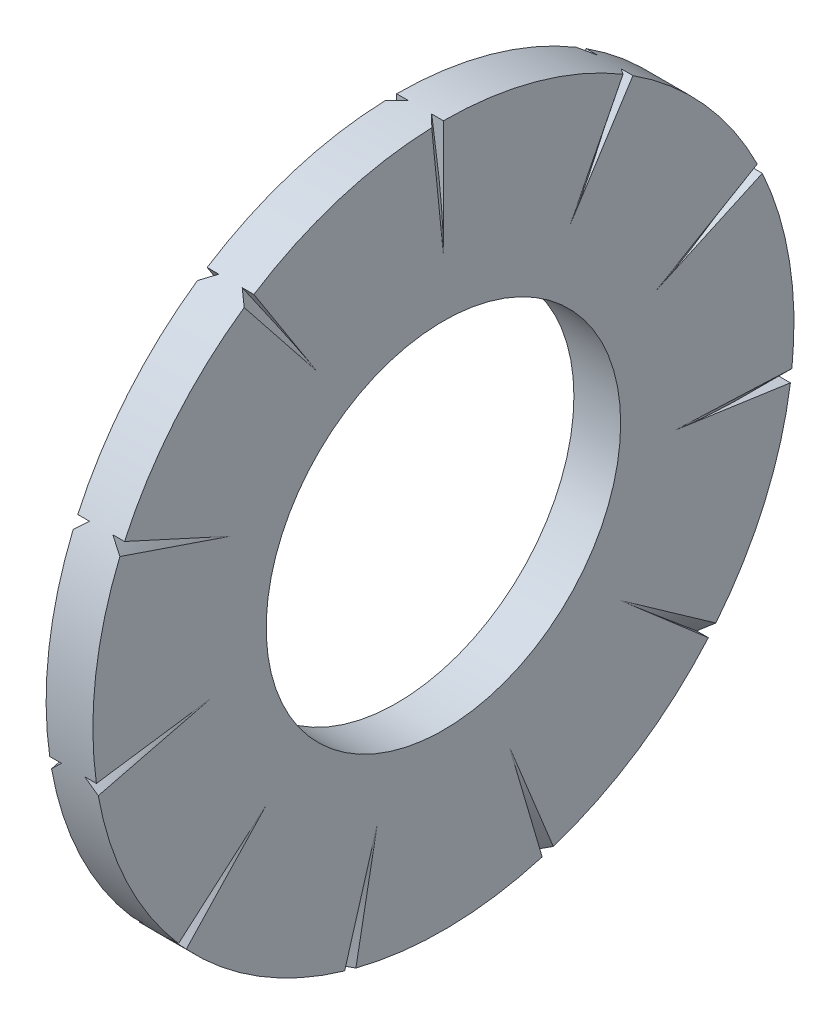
ISO-10303-21;
HEADER;
FILE_DESCRIPTION(('STEP AP214'),'2;1');
FILE_NAME('part.step','',(''),(''),'','','');
FILE_SCHEMA(('AUTOMOTIVE_DESIGN { 1 0 10303 214 1 1 1 1 }'));
ENDSEC;
DATA;
#1=APPLICATION_CONTEXT('core data for automotive mechanical design processes');
#2=APPLICATION_PROTOCOL_DEFINITION('international standard','automotive_design',2000,#1);
#3=PRODUCT_CONTEXT('',#1,'mechanical');
#4=PRODUCT('Part','Part','',(#3));
#5=PRODUCT_RELATED_PRODUCT_CATEGORY('part','',(#4));
#6=PRODUCT_DEFINITION_FORMATION('','',#4);
#7=PRODUCT_DEFINITION_CONTEXT('part definition',#1,'design');
#8=PRODUCT_DEFINITION('design','',#6,#7);
#9=PRODUCT_DEFINITION_SHAPE('','',#8);
#10=(LENGTH_UNIT() NAMED_UNIT(*) SI_UNIT(.MILLI.,.METRE.));
#11=(NAMED_UNIT(*) PLANE_ANGLE_UNIT() SI_UNIT($,.RADIAN.));
#12=(NAMED_UNIT(*) SI_UNIT($,.STERADIAN.) SOLID_ANGLE_UNIT());
#13=UNCERTAINTY_MEASURE_WITH_UNIT(LENGTH_MEASURE(1.E-05),#10,'distance_accuracy_value','');
#14=(GEOMETRIC_REPRESENTATION_CONTEXT(3) GLOBAL_UNCERTAINTY_ASSIGNED_CONTEXT((#13)) GLOBAL_UNIT_ASSIGNED_CONTEXT((#10,
#11,#12)) REPRESENTATION_CONTEXT('',''));
#15=CARTESIAN_POINT('',(0.,0.,0.));
#16=DIRECTION('',(0.,0.,1.));
#17=DIRECTION('',(1.,0.,0.));
#18=AXIS2_PLACEMENT_3D('',#15,#16,#17);
#19=CARTESIAN_POINT('',(0.6,0.,0.));
#20=DIRECTION('',(1.,0.,0.));
#21=DIRECTION('',(0.,0.,-1.));
#22=AXIS2_PLACEMENT_3D('',#19,#20,#21);
#23=PLANE('',#22);
#24=DIRECTION('',(0.,-0.782900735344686,-0.622146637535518));
#25=VECTOR('',#24,1.);
#26=CARTESIAN_POINT('',(0.6,3.11804348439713,2.09299754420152));
#27=LINE('',#26,#25);
#28=CARTESIAN_POINT('',(0.6,3.70258366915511,2.55751327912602));
#29=VERTEX_POINT('',#28);
#30=CARTESIAN_POINT('',(0.6,2.53154219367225,1.62692337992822));
#31=VERTEX_POINT('',#30);
#32=EDGE_CURVE('E886',#29,#31,#27,.T.);
#33=ORIENTED_EDGE('',*,*,#32,.F.);
#34=CARTESIAN_POINT('',(0.6,0.,0.));
#35=DIRECTION('',(1.,0.,0.));
#36=DIRECTION('',(0.,0.,-1.));
#37=AXIS2_PLACEMENT_3D('',#34,#35,#36);
#38=CIRCLE('',#37,4.5);
#39=CARTESIAN_POINT('',(0.6,1.86936755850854,4.09334397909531));
#40=VERTEX_POINT('',#39);
#41=EDGE_CURVE('E1085',#29,#40,#38,.T.);
#42=ORIENTED_EDGE('',*,*,#41,.T.);
#43=DIRECTION('',(0.,0.415415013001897,0.909631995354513));
#44=VECTOR('',#43,1.);
#45=CARTESIAN_POINT('',(0.6,1.55972759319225,3.41532703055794));
#46=LINE('',#45,#44);
#47=CARTESIAN_POINT('',(0.6,1.25008762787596,2.73731008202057));
#48=VERTEX_POINT('',#47);
#49=EDGE_CURVE('E900',#48,#40,#46,.T.);
#50=ORIENTED_EDGE('',*,*,#49,.F.);
#51=DIRECTION('',(0.,-0.322260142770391,-0.946651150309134));
#52=VECTOR('',#51,1.);
#53=CARTESIAN_POINT('',(0.6,1.49150519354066,3.44648315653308));
#54=LINE('',#53,#52);
#55=CARTESIAN_POINT('',(0.6,1.73211552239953,4.15328494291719));
#56=VERTEX_POINT('',#55);
#57=EDGE_CURVE('E901',#56,#48,#54,.T.);
#58=ORIENTED_EDGE('',*,*,#57,.F.);
#59=CARTESIAN_POINT('',(0.6,-0.640416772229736,4.4541964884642));
#60=VERTEX_POINT('',#59);
#61=EDGE_CURVE('E1137',#56,#60,#38,.T.);
#62=ORIENTED_EDGE('',*,*,#61,.T.);
#63=DIRECTION('',(0.,-0.142314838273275,0.989821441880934));
#64=VECTOR('',#63,1.);
#65=CARTESIAN_POINT('',(0.6,-0.534338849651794,3.7164083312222));
#66=LINE('',#65,#64);
#67=CARTESIAN_POINT('',(0.6,-0.428260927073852,2.9786201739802));
#68=VERTEX_POINT('',#67);
#69=EDGE_CURVE('E916',#68,#60,#66,.T.);
#70=ORIENTED_EDGE('',*,*,#69,.F.);
#71=DIRECTION('',(0.,0.240695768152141,-0.970600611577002));
#72=VECTOR('',#71,1.);
#73=CARTESIAN_POINT('',(0.6,-0.608575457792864,3.70573471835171));
#74=LINE('',#73,#72);
#75=CARTESIAN_POINT('',(0.6,-0.788287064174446,4.43041798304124));
#76=VERTEX_POINT('',#75);
#77=EDGE_CURVE('E917',#76,#68,#74,.T.);
#78=ORIENTED_EDGE('',*,*,#77,.F.);
#79=CARTESIAN_POINT('',(0.6,-2.94687330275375,3.40087308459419));
#80=VERTEX_POINT('',#79);
#81=EDGE_CURVE('E1138',#76,#80,#38,.T.);
#82=ORIENTED_EDGE('',*,*,#81,.T.);
#83=DIRECTION('',(0.,-0.654860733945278,0.755749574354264));
#84=VECTOR('',#83,1.);
#85=CARTESIAN_POINT('',(0.6,-2.45875648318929,2.83755624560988));
#86=LINE('',#85,#84);
#87=CARTESIAN_POINT('',(0.6,-1.97063966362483,2.27423940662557));
#88=VERTEX_POINT('',#87);
#89=EDGE_CURVE('E932',#88,#80,#86,.T.);
#90=ORIENTED_EDGE('',*,*,#89,.F.);
#91=DIRECTION('',(0.,0.727232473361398,-0.686391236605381));
#92=VECTOR('',#91,1.);
#93=CARTESIAN_POINT('',(0.6,-2.51543770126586,2.78844169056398));
#94=LINE('',#93,#92);
#95=CARTESIAN_POINT('',(0.6,-3.05841407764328,3.30092461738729));
#96=VERTEX_POINT('',#95);
#97=EDGE_CURVE('E933',#96,#88,#94,.T.);
#98=ORIENTED_EDGE('',*,*,#97,.F.);
#99=CARTESIAN_POINT('',(0.6,-4.31771838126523,1.26779650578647));
#100=VERTEX_POINT('',#99);
#101=EDGE_CURVE('E1142',#96,#100,#38,.T.);
#102=ORIENTED_EDGE('',*,*,#101,.T.);
#103=DIRECTION('',(0.,-0.959492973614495,0.281732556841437));
#104=VECTOR('',#103,1.);
#105=CARTESIAN_POINT('',(0.6,-3.60253630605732,1.05780010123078));
#106=LINE('',#105,#104);
#107=CARTESIAN_POINT('',(0.6,-2.88735423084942,0.847803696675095));
#108=VERTEX_POINT('',#107);
#109=EDGE_CURVE('E948',#108,#100,#106,.T.);
#110=ORIENTED_EDGE('',*,*,#109,.F.);
#111=DIRECTION('',(0.,0.982878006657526,-0.184257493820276));
#112=VECTOR('',#111,1.);
#113=CARTESIAN_POINT('',(0.6,-3.62366624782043,0.985838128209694));
#114=LINE('',#113,#112);
#115=CARTESIAN_POINT('',(0.6,-4.3575162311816,1.1234110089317));
#116=VERTEX_POINT('',#115);
#117=EDGE_CURVE('E949',#116,#108,#114,.T.);
#118=ORIENTED_EDGE('',*,*,#117,.F.);
#119=CARTESIAN_POINT('',(0.6,-4.31771838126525,-1.2677965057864));
#120=VERTEX_POINT('',#119);
#121=EDGE_CURVE('E1146',#116,#120,#38,.T.);
#122=ORIENTED_EDGE('',*,*,#121,.T.);
#123=DIRECTION('',(0.,-0.959492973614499,-0.281732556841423));
#124=VECTOR('',#123,1.);
#125=CARTESIAN_POINT('',(0.6,-3.60253630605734,-1.05780010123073));
#126=LINE('',#125,#124);
#127=CARTESIAN_POINT('',(0.6,-2.88735423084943,-0.847803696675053));
#128=VERTEX_POINT('',#127);
#129=EDGE_CURVE('E964',#128,#120,#126,.T.);
#130=ORIENTED_EDGE('',*,*,#129,.F.);
#131=DIRECTION('',(0.,0.926466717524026,0.376376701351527));
#132=VECTOR('',#131,1.);
#133=CARTESIAN_POINT('',(0.6,-3.58140636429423,-1.12976207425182));
#134=LINE('',#133,#132);
#135=CARTESIAN_POINT('',(0.6,-4.27313777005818,-1.41077765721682));
#136=VERTEX_POINT('',#135);
#137=EDGE_CURVE('E965',#136,#128,#134,.T.);
#138=ORIENTED_EDGE('',*,*,#137,.F.);
#139=CARTESIAN_POINT('',(0.6,-2.9468733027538,-3.40087308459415));
#140=VERTEX_POINT('',#139);
#141=EDGE_CURVE('E1150',#136,#140,#38,.T.);
#142=ORIENTED_EDGE('',*,*,#141,.T.);
#143=DIRECTION('',(0.,-0.654860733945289,-0.755749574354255));
#144=VECTOR('',#143,1.);
#145=CARTESIAN_POINT('',(0.6,-2.45875648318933,-2.83755624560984));
#146=LINE('',#145,#144);
#147=CARTESIAN_POINT('',(0.6,-1.97063966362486,-2.27423940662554));
#148=VERTEX_POINT('',#147);
#149=EDGE_CURVE('E980',#148,#140,#146,.T.);
#150=ORIENTED_EDGE('',*,*,#149,.F.);
#151=DIRECTION('',(0.,0.575908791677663,0.817513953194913));
#152=VECTOR('',#151,1.);
#153=CARTESIAN_POINT('',(0.6,-2.40207526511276,-2.88667080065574));
#154=LINE('',#153,#152);
#155=CARTESIAN_POINT('',(0.6,-2.83206825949,-3.4970543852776));
#156=VERTEX_POINT('',#155);
#157=EDGE_CURVE('E981',#156,#148,#154,.T.);
#158=ORIENTED_EDGE('',*,*,#157,.F.);
#159=CARTESIAN_POINT('',(0.6,-0.640416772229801,-4.45419648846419));
#160=VERTEX_POINT('',#159);
#161=EDGE_CURVE('E1154',#156,#160,#38,.T.);
#162=ORIENTED_EDGE('',*,*,#161,.T.);
#163=DIRECTION('',(0.,-0.142314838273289,-0.989821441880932));
#164=VECTOR('',#163,1.);
#165=CARTESIAN_POINT('',(0.6,-0.534338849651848,-3.7164083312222));
#166=LINE('',#165,#164);
#167=CARTESIAN_POINT('',(0.6,-0.428260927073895,-2.9786201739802));
#168=VERTEX_POINT('',#167);
#169=EDGE_CURVE('E996',#168,#160,#166,.T.);
#170=ORIENTED_EDGE('',*,*,#169,.F.);
#171=DIRECTION('',(0.,0.0425038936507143,0.999096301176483));
#172=VECTOR('',#171,1.);
#173=CARTESIAN_POINT('',(0.6,-0.460102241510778,-3.72708194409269));
#174=LINE('',#173,#172);
#175=CARTESIAN_POINT('',(0.6,-0.491837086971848,-4.47304105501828));
#176=VERTEX_POINT('',#175);
#177=EDGE_CURVE('E997',#176,#168,#174,.T.);
#178=ORIENTED_EDGE('',*,*,#177,.F.);
#179=CARTESIAN_POINT('',(0.6,1.86936755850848,-4.09334397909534));
#180=VERTEX_POINT('',#179);
#181=EDGE_CURVE('E1158',#176,#180,#38,.T.);
#182=ORIENTED_EDGE('',*,*,#181,.T.);
#183=DIRECTION('',(0.,0.415415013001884,-0.909631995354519));
#184=VECTOR('',#183,1.);
#185=CARTESIAN_POINT('',(0.6,1.5597275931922,-3.41532703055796));
#186=LINE('',#185,#184);
#187=CARTESIAN_POINT('',(0.6,1.25008762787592,-2.73731008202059));
#188=VERTEX_POINT('',#187);
#189=EDGE_CURVE('E1012',#188,#180,#186,.T.);
#190=ORIENTED_EDGE('',*,*,#189,.F.);
#191=DIRECTION('',(0.,-0.504395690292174,0.863472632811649));
#192=VECTOR('',#191,1.);
#193=CARTESIAN_POINT('',(0.6,1.62794999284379,-3.38417090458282));
#194=LINE('',#193,#192);
#195=CARTESIAN_POINT('',(0.6,2.00454888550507,-4.02886879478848));
#196=VERTEX_POINT('',#195);
#197=EDGE_CURVE('E1013',#196,#188,#194,.T.);
#198=ORIENTED_EDGE('',*,*,#197,.F.);
#199=CARTESIAN_POINT('',(0.6,3.78564089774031,-2.43288367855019));
#200=VERTEX_POINT('',#199);
#201=EDGE_CURVE('E1162',#196,#200,#38,.T.);
#202=ORIENTED_EDGE('',*,*,#201,.T.);
#203=DIRECTION('',(0.,0.841253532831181,-0.540640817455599));
#204=VECTOR('',#203,1.);
#205=CARTESIAN_POINT('',(0.6,3.15859154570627,-2.02990352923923));
#206=LINE('',#205,#204);
#207=CARTESIAN_POINT('',(0.6,2.53154219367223,-1.62692337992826));
#208=VERTEX_POINT('',#207);
#209=EDGE_CURVE('E1028',#208,#200,#206,.T.);
#210=ORIENTED_EDGE('',*,*,#209,.F.);
#211=DIRECTION('',(0.,-0.891153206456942,0.453702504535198));
#212=VECTOR('',#211,1.);
#213=CARTESIAN_POINT('',(0.6,3.19913960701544,-1.96680951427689));
#214=LINE('',#213,#212);
#215=CARTESIAN_POINT('',(0.6,3.86450475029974,-2.30555915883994));
#216=VERTEX_POINT('',#215);
#217=EDGE_CURVE('E1029',#216,#208,#214,.T.);
#218=ORIENTED_EDGE('',*,*,#217,.F.);
#219=CARTESIAN_POINT('',(0.6,4.5,0.));
#220=VERTEX_POINT('',#219);
#221=EDGE_CURVE('E1080',#216,#220,#38,.T.);
#222=ORIENTED_EDGE('',*,*,#221,.T.);
#223=DIRECTION('',(0.,1.,0.));
#224=VECTOR('',#223,1.);
#225=CARTESIAN_POINT('',(0.6,3.754625,0.));
#226=LINE('',#225,#224);
#227=CARTESIAN_POINT('',(0.6,3.00925,0.));
#228=VERTEX_POINT('',#227);
#229=EDGE_CURVE('E1060',#228,#220,#226,.T.);
#230=ORIENTED_EDGE('',*,*,#229,.F.);
#231=DIRECTION('',(0.,-0.994975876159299,-0.100114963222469));
#232=VECTOR('',#231,1.);
#233=CARTESIAN_POINT('',(0.6,3.754625,0.075));
#234=LINE('',#233,#232);
#235=CARTESIAN_POINT('',(0.6,4.49750766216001,0.149749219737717));
#236=VERTEX_POINT('',#235);
#237=EDGE_CURVE('E1061',#236,#228,#234,.T.);
#238=ORIENTED_EDGE('',*,*,#237,.F.);
#239=CARTESIAN_POINT('',(0.6,3.78564089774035,2.43288367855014));
#240=VERTEX_POINT('',#239);
#241=EDGE_CURVE('E1081',#236,#240,#38,.T.);
#242=ORIENTED_EDGE('',*,*,#241,.T.);
#243=DIRECTION('',(0.,0.841253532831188,0.540640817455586));
#244=VECTOR('',#243,1.);
#245=CARTESIAN_POINT('',(0.6,3.1585915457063,2.02990352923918));
#246=LINE('',#245,#244);
#247=EDGE_CURVE('E885',#31,#240,#246,.T.);
#248=ORIENTED_EDGE('',*,*,#247,.F.);
#249=EDGE_LOOP('',(#33,#42,#50,#58,#62,#70,#78,#82,#90,#98,#102,#110,#118,#122,#130,#138,#142,
#150,#158,#162,#170,#178,#182,#190,#198,#202,#210,#218,#222,#230,#238,#242,#248));
#250=FACE_BOUND('',#249,.T.);
#251=CARTESIAN_POINT('',(0.6,0.,0.));
#252=DIRECTION('',(1.,0.,0.));
#253=DIRECTION('',(0.,0.,-1.));
#254=AXIS2_PLACEMENT_3D('',#251,#252,#253);
#255=CIRCLE('',#254,2.275);
#256=CARTESIAN_POINT('',(0.6,0.,-2.275));
#257=VERTEX_POINT('',#256);
#258=EDGE_CURVE('E1074',#257,#257,#255,.T.);
#259=ORIENTED_EDGE('',*,*,#258,.F.);
#260=EDGE_LOOP('',(#259));
#261=FACE_BOUND('',#260,.T.);
#262=ADVANCED_FACE('F430',(#250,#261),#23,.T.);
#263=CARTESIAN_POINT('',(0.,0.,0.));
#264=DIRECTION('',(1.,0.,0.));
#265=DIRECTION('',(0.,0.,-1.));
#266=AXIS2_PLACEMENT_3D('',#263,#264,#265);
#267=PLANE('',#266);
#268=CARTESIAN_POINT('',(0.,0.,0.));
#269=DIRECTION('',(1.,0.,0.));
#270=DIRECTION('',(0.,0.,-1.));
#271=AXIS2_PLACEMENT_3D('',#268,#269,#270);
#272=CIRCLE('',#271,4.5);
#273=CARTESIAN_POINT('',(0.,3.70258366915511,2.55751327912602));
#274=VERTEX_POINT('',#273);
#275=CARTESIAN_POINT('',(0.,1.86936755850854,4.09334397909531));
#276=VERTEX_POINT('',#275);
#277=EDGE_CURVE('E732',#274,#276,#272,.T.);
#278=ORIENTED_EDGE('',*,*,#277,.F.);
#279=DIRECTION('',(0.,-0.782900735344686,-0.622146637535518));
#280=VECTOR('',#279,1.);
#281=CARTESIAN_POINT('',(0.,3.11804348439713,2.09299754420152));
#282=LINE('',#281,#280);
#283=CARTESIAN_POINT('',(0.,2.53154219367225,1.62692337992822));
#284=VERTEX_POINT('',#283);
#285=EDGE_CURVE('E717',#274,#284,#282,.T.);
#286=ORIENTED_EDGE('',*,*,#285,.T.);
#287=DIRECTION('',(0.,0.841253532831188,0.540640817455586));
#288=VECTOR('',#287,1.);
#289=CARTESIAN_POINT('',(0.,3.1585915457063,2.02990352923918));
#290=LINE('',#289,#288);
#291=CARTESIAN_POINT('',(0.,3.78564089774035,2.43288367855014));
#292=VERTEX_POINT('',#291);
#293=EDGE_CURVE('E719',#284,#292,#290,.T.);
#294=ORIENTED_EDGE('',*,*,#293,.T.);
#295=CARTESIAN_POINT('',(0.,4.49750766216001,0.149749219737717));
#296=VERTEX_POINT('',#295);
#297=EDGE_CURVE('E1078',#296,#292,#272,.T.);
#298=ORIENTED_EDGE('',*,*,#297,.F.);
#299=DIRECTION('',(0.,-0.994975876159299,-0.100114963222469));
#300=VECTOR('',#299,1.);
#301=CARTESIAN_POINT('',(0.,3.754625,0.075));
#302=LINE('',#301,#300);
#303=CARTESIAN_POINT('',(0.,3.00925,0.));
#304=VERTEX_POINT('',#303);
#305=EDGE_CURVE('E1044',#296,#304,#302,.T.);
#306=ORIENTED_EDGE('',*,*,#305,.T.);
#307=DIRECTION('',(0.,1.,0.));
#308=VECTOR('',#307,1.);
#309=CARTESIAN_POINT('',(0.,3.754625,0.));
#310=LINE('',#309,#308);
#311=CARTESIAN_POINT('',(0.,4.5,0.));
#312=VERTEX_POINT('',#311);
#313=EDGE_CURVE('E1043',#304,#312,#310,.T.);
#314=ORIENTED_EDGE('',*,*,#313,.T.);
#315=CARTESIAN_POINT('',(0.,3.86450475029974,-2.30555915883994));
#316=VERTEX_POINT('',#315);
#317=EDGE_CURVE('E1077',#316,#312,#272,.T.);
#318=ORIENTED_EDGE('',*,*,#317,.F.);
#319=DIRECTION('',(0.,-0.891153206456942,0.453702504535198));
#320=VECTOR('',#319,1.);
#321=CARTESIAN_POINT('',(0.,3.19913960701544,-1.96680951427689));
#322=LINE('',#321,#320);
#323=CARTESIAN_POINT('',(0.,2.53154219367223,-1.62692337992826));
#324=VERTEX_POINT('',#323);
#325=EDGE_CURVE('E869',#316,#324,#322,.T.);
#326=ORIENTED_EDGE('',*,*,#325,.T.);
#327=DIRECTION('',(0.,0.841253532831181,-0.540640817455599));
#328=VECTOR('',#327,1.);
#329=CARTESIAN_POINT('',(0.,3.15859154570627,-2.02990352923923));
#330=LINE('',#329,#328);
#331=CARTESIAN_POINT('',(0.,3.78564089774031,-2.43288367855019));
#332=VERTEX_POINT('',#331);
#333=EDGE_CURVE('E868',#324,#332,#330,.T.);
#334=ORIENTED_EDGE('',*,*,#333,.T.);
#335=CARTESIAN_POINT('',(0.,2.00454888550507,-4.02886879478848));
#336=VERTEX_POINT('',#335);
#337=EDGE_CURVE('E1415',#336,#332,#272,.T.);
#338=ORIENTED_EDGE('',*,*,#337,.F.);
#339=DIRECTION('',(0.,-0.504395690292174,0.863472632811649));
#340=VECTOR('',#339,1.);
#341=CARTESIAN_POINT('',(0.,1.62794999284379,-3.38417090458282));
#342=LINE('',#341,#340);
#343=CARTESIAN_POINT('',(0.,1.25008762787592,-2.73731008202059));
#344=VERTEX_POINT('',#343);
#345=EDGE_CURVE('E853',#336,#344,#342,.T.);
#346=ORIENTED_EDGE('',*,*,#345,.T.);
#347=DIRECTION('',(0.,0.415415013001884,-0.909631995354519));
#348=VECTOR('',#347,1.);
#349=CARTESIAN_POINT('',(0.,1.5597275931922,-3.41532703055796));
#350=LINE('',#349,#348);
#351=CARTESIAN_POINT('',(0.,1.86936755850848,-4.09334397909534));
#352=VERTEX_POINT('',#351);
#353=EDGE_CURVE('E852',#344,#352,#350,.T.);
#354=ORIENTED_EDGE('',*,*,#353,.T.);
#355=CARTESIAN_POINT('',(0.,-0.491837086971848,-4.47304105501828));
#356=VERTEX_POINT('',#355);
#357=EDGE_CURVE('E1416',#356,#352,#272,.T.);
#358=ORIENTED_EDGE('',*,*,#357,.F.);
#359=DIRECTION('',(0.,0.0425038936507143,0.999096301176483));
#360=VECTOR('',#359,1.);
#361=CARTESIAN_POINT('',(0.,-0.460102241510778,-3.72708194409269));
#362=LINE('',#361,#360);
#363=CARTESIAN_POINT('',(0.,-0.428260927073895,-2.9786201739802));
#364=VERTEX_POINT('',#363);
#365=EDGE_CURVE('E837',#356,#364,#362,.T.);
#366=ORIENTED_EDGE('',*,*,#365,.T.);
#367=DIRECTION('',(0.,-0.142314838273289,-0.989821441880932));
#368=VECTOR('',#367,1.);
#369=CARTESIAN_POINT('',(0.,-0.534338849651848,-3.7164083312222));
#370=LINE('',#369,#368);
#371=CARTESIAN_POINT('',(0.,-0.6404167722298,-4.45419648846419));
#372=VERTEX_POINT('',#371);
#373=EDGE_CURVE('E836',#364,#372,#370,.T.);
#374=ORIENTED_EDGE('',*,*,#373,.T.);
#375=CARTESIAN_POINT('',(0.,-2.83206825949,-3.4970543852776));
#376=VERTEX_POINT('',#375);
#377=EDGE_CURVE('E1420',#376,#372,#272,.T.);
#378=ORIENTED_EDGE('',*,*,#377,.F.);
#379=DIRECTION('',(0.,0.575908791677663,0.817513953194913));
#380=VECTOR('',#379,1.);
#381=CARTESIAN_POINT('',(0.,-2.40207526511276,-2.88667080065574));
#382=LINE('',#381,#380);
#383=CARTESIAN_POINT('',(0.,-1.97063966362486,-2.27423940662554));
#384=VERTEX_POINT('',#383);
#385=EDGE_CURVE('E821',#376,#384,#382,.T.);
#386=ORIENTED_EDGE('',*,*,#385,.T.);
#387=DIRECTION('',(0.,-0.654860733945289,-0.755749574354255));
#388=VECTOR('',#387,1.);
#389=CARTESIAN_POINT('',(0.,-2.45875648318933,-2.83755624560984));
#390=LINE('',#389,#388);
#391=CARTESIAN_POINT('',(0.,-2.9468733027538,-3.40087308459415));
#392=VERTEX_POINT('',#391);
#393=EDGE_CURVE('E820',#384,#392,#390,.T.);
#394=ORIENTED_EDGE('',*,*,#393,.T.);
#395=CARTESIAN_POINT('',(0.,-4.27313777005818,-1.41077765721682));
#396=VERTEX_POINT('',#395);
#397=EDGE_CURVE('E1424',#396,#392,#272,.T.);
#398=ORIENTED_EDGE('',*,*,#397,.F.);
#399=DIRECTION('',(0.,0.926466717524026,0.376376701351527));
#400=VECTOR('',#399,1.);
#401=CARTESIAN_POINT('',(0.,-3.58140636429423,-1.12976207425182));
#402=LINE('',#401,#400);
#403=CARTESIAN_POINT('',(0.,-2.88735423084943,-0.847803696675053));
#404=VERTEX_POINT('',#403);
#405=EDGE_CURVE('E805',#396,#404,#402,.T.);
#406=ORIENTED_EDGE('',*,*,#405,.T.);
#407=DIRECTION('',(0.,-0.959492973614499,-0.281732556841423));
#408=VECTOR('',#407,1.);
#409=CARTESIAN_POINT('',(0.,-3.60253630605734,-1.05780010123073));
#410=LINE('',#409,#408);
#411=CARTESIAN_POINT('',(0.,-4.31771838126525,-1.2677965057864));
#412=VERTEX_POINT('',#411);
#413=EDGE_CURVE('E804',#404,#412,#410,.T.);
#414=ORIENTED_EDGE('',*,*,#413,.T.);
#415=CARTESIAN_POINT('',(0.,-4.3575162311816,1.1234110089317));
#416=VERTEX_POINT('',#415);
#417=EDGE_CURVE('E1428',#416,#412,#272,.T.);
#418=ORIENTED_EDGE('',*,*,#417,.F.);
#419=DIRECTION('',(0.,0.982878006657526,-0.184257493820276));
#420=VECTOR('',#419,1.);
#421=CARTESIAN_POINT('',(0.,-3.62366624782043,0.985838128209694));
#422=LINE('',#421,#420);
#423=CARTESIAN_POINT('',(0.,-2.88735423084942,0.847803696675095));
#424=VERTEX_POINT('',#423);
#425=EDGE_CURVE('E789',#416,#424,#422,.T.);
#426=ORIENTED_EDGE('',*,*,#425,.T.);
#427=DIRECTION('',(0.,-0.959492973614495,0.281732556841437));
#428=VECTOR('',#427,1.);
#429=CARTESIAN_POINT('',(0.,-3.60253630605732,1.05780010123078));
#430=LINE('',#429,#428);
#431=CARTESIAN_POINT('',(0.,-4.31771838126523,1.26779650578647));
#432=VERTEX_POINT('',#431);
#433=EDGE_CURVE('E788',#424,#432,#430,.T.);
#434=ORIENTED_EDGE('',*,*,#433,.T.);
#435=CARTESIAN_POINT('',(0.,-3.05841407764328,3.30092461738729));
#436=VERTEX_POINT('',#435);
#437=EDGE_CURVE('E1432',#436,#432,#272,.T.);
#438=ORIENTED_EDGE('',*,*,#437,.F.);
#439=DIRECTION('',(0.,0.727232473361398,-0.686391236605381));
#440=VECTOR('',#439,1.);
#441=CARTESIAN_POINT('',(0.,-2.51543770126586,2.78844169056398));
#442=LINE('',#441,#440);
#443=CARTESIAN_POINT('',(0.,-1.97063966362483,2.27423940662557));
#444=VERTEX_POINT('',#443);
#445=EDGE_CURVE('E773',#436,#444,#442,.T.);
#446=ORIENTED_EDGE('',*,*,#445,.T.);
#447=DIRECTION('',(0.,-0.654860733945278,0.755749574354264));
#448=VECTOR('',#447,1.);
#449=CARTESIAN_POINT('',(0.,-2.45875648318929,2.83755624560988));
#450=LINE('',#449,#448);
#451=CARTESIAN_POINT('',(0.,-2.94687330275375,3.40087308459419));
#452=VERTEX_POINT('',#451);
#453=EDGE_CURVE('E772',#444,#452,#450,.T.);
#454=ORIENTED_EDGE('',*,*,#453,.T.);
#455=CARTESIAN_POINT('',(0.,-0.788287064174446,4.43041798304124));
#456=VERTEX_POINT('',#455);
#457=EDGE_CURVE('E1436',#456,#452,#272,.T.);
#458=ORIENTED_EDGE('',*,*,#457,.F.);
#459=DIRECTION('',(0.,0.240695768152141,-0.970600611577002));
#460=VECTOR('',#459,1.);
#461=CARTESIAN_POINT('',(0.,-0.608575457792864,3.70573471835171));
#462=LINE('',#461,#460);
#463=CARTESIAN_POINT('',(0.,-0.428260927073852,2.9786201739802));
#464=VERTEX_POINT('',#463);
#465=EDGE_CURVE('E757',#456,#464,#462,.T.);
#466=ORIENTED_EDGE('',*,*,#465,.T.);
#467=DIRECTION('',(0.,-0.142314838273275,0.989821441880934));
#468=VECTOR('',#467,1.);
#469=CARTESIAN_POINT('',(0.,-0.534338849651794,3.7164083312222));
#470=LINE('',#469,#468);
#471=CARTESIAN_POINT('',(0.,-0.640416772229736,4.4541964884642));
#472=VERTEX_POINT('',#471);
#473=EDGE_CURVE('E756',#464,#472,#470,.T.);
#474=ORIENTED_EDGE('',*,*,#473,.T.);
#475=CARTESIAN_POINT('',(0.,1.73211552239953,4.15328494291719));
#476=VERTEX_POINT('',#475);
#477=EDGE_CURVE('E1440',#476,#472,#272,.T.);
#478=ORIENTED_EDGE('',*,*,#477,.F.);
#479=DIRECTION('',(0.,-0.322260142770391,-0.946651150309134));
#480=VECTOR('',#479,1.);
#481=CARTESIAN_POINT('',(0.,1.49150519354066,3.44648315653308));
#482=LINE('',#481,#480);
#483=CARTESIAN_POINT('',(0.,1.25008762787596,2.73731008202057));
#484=VERTEX_POINT('',#483);
#485=EDGE_CURVE('E742',#476,#484,#482,.T.);
#486=ORIENTED_EDGE('',*,*,#485,.T.);
#487=DIRECTION('',(0.,0.415415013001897,0.909631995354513));
#488=VECTOR('',#487,1.);
#489=CARTESIAN_POINT('',(0.,1.55972759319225,3.41532703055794));
#490=LINE('',#489,#488);
#491=EDGE_CURVE('E741',#484,#276,#490,.T.);
#492=ORIENTED_EDGE('',*,*,#491,.T.);
#493=EDGE_LOOP('',(#278,#286,#294,#298,#306,#314,#318,#326,#334,#338,#346,#354,#358,#366,#374,
#378,#386,#394,#398,#406,#414,#418,#426,#434,#438,#446,#454,#458,#466,#474,#478,#486,#492));
#494=FACE_BOUND('',#493,.T.);
#495=CARTESIAN_POINT('',(0.,0.,0.));
#496=DIRECTION('',(1.,0.,0.));
#497=DIRECTION('',(0.,0.,-1.));
#498=AXIS2_PLACEMENT_3D('',#495,#496,#497);
#499=CIRCLE('',#498,2.275);
#500=CARTESIAN_POINT('',(0.,0.,-2.275));
#501=VERTEX_POINT('',#500);
#502=EDGE_CURVE('E1071',#501,#501,#499,.T.);
#503=ORIENTED_EDGE('',*,*,#502,.T.);
#504=EDGE_LOOP('',(#503));
#505=FACE_BOUND('',#504,.T.);
#506=ADVANCED_FACE('F729',(#494,#505),#267,.F.);
#507=CARTESIAN_POINT('',(0.6,0.,0.));
#508=DIRECTION('',(-1.,0.,0.));
#509=DIRECTION('',(0.,0.,1.));
#510=AXIS2_PLACEMENT_3D('',#507,#508,#509);
#511=CYLINDRICAL_SURFACE('',#510,4.5);
#512=ORIENTED_EDGE('',*,*,#41,.F.);
#513=CARTESIAN_POINT('',(0.6,3.70258366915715,2.55751327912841));
#514=CARTESIAN_POINT('',(0.587487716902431,3.70968095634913,2.5472382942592));
#515=CARTESIAN_POINT('',(0.574974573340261,3.71673500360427,2.53693452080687));
#516=CARTESIAN_POINT('',(0.549948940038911,3.7307574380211,2.51626806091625));
#517=CARTESIAN_POINT('',(0.537436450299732,3.73772582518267,2.50590537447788));
#518=CARTESIAN_POINT('',(0.49994112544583,3.75848291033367,2.47475817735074));
#519=CARTESIAN_POINT('',(0.47496281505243,3.7721448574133,2.45388365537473));
#520=CARTESIAN_POINT('',(0.45,3.78564089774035,2.43288367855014));
#521=B_SPLINE_CURVE_WITH_KNOTS('',3,(#513,#514,#515,#516,#517,#518,#519,#520),.UNSPECIFIED.,.F.,
.F.,(4,2,2,4),(0.,0.0530332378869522,0.106066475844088,0.211973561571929),.UNSPECIFIED.);
#522=CARTESIAN_POINT('',(0.45,3.78564089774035,2.43288367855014));
#523=VERTEX_POINT('',#522);
#524=EDGE_CURVE('E1135',#29,#523,#521,.T.);
#525=ORIENTED_EDGE('',*,*,#524,.T.);
#526=DIRECTION('',(-1.,0.,0.));
#527=VECTOR('',#526,1.);
#528=CARTESIAN_POINT('',(0.45,3.78564089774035,2.43288367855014));
#529=LINE('',#528,#527);
#530=EDGE_CURVE('E891',#240,#523,#529,.T.);
#531=ORIENTED_EDGE('',*,*,#530,.F.);
#532=ORIENTED_EDGE('',*,*,#241,.F.);
#533=CARTESIAN_POINT('',(0.6,4.49750766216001,0.149749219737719));
#534=CARTESIAN_POINT('',(0.587487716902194,4.4979232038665,0.13726826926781));
#535=CARTESIAN_POINT('',(0.574974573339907,4.49828680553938,0.124786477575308));
#536=CARTESIAN_POINT('',(0.549948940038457,4.498910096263,0.0998196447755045));
#537=CARTESIAN_POINT('',(0.537436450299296,4.49916978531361,0.0873346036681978));
#538=CARTESIAN_POINT('',(0.49994112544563,4.49979231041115,0.0499097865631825));
#539=CARTESIAN_POINT('',(0.4749628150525,4.49999985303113,0.0249628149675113));
#540=CARTESIAN_POINT('',(0.45,4.5,0.));
#541=B_SPLINE_CURVE_WITH_KNOTS('',3,(#533,#534,#535,#536,#537,#538,#539,#540),.UNSPECIFIED.,.F.,
.F.,(4,2,2,4),(0.,0.0530332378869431,0.106066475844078,0.21197356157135),.UNSPECIFIED.);
#542=CARTESIAN_POINT('',(0.45,4.5,0.));
#543=VERTEX_POINT('',#542);
#544=EDGE_CURVE('E1084',#236,#543,#541,.T.);
#545=ORIENTED_EDGE('',*,*,#544,.T.);
#546=DIRECTION('',(-1.,0.,0.));
#547=VECTOR('',#546,1.);
#548=CARTESIAN_POINT('',(0.45,4.5,0.));
#549=LINE('',#548,#547);
#550=EDGE_CURVE('E1066',#220,#543,#549,.T.);
#551=ORIENTED_EDGE('',*,*,#550,.F.);
#552=ORIENTED_EDGE('',*,*,#221,.F.);
#553=CARTESIAN_POINT('',(0.6,3.86450475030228,-2.30555915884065));
#554=CARTESIAN_POINT('',(0.587487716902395,3.85810661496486,-2.31628346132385));
#555=CARTESIAN_POINT('',(0.574974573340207,3.85166433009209,-2.32698039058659));
#556=CARTESIAN_POINT('',(0.549948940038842,3.83869058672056,-2.34832080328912));
#557=CARTESIAN_POINT('',(0.537436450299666,3.8321591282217,-2.35896428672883));
#558=CARTESIAN_POINT('',(0.4999411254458,3.81244944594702,-2.39078460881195));
#559=CARTESIAN_POINT('',(0.47496281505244,3.79913669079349,-2.4118835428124));
#560=CARTESIAN_POINT('',(0.45,3.78564089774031,-2.43288367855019));
#561=B_SPLINE_CURVE_WITH_KNOTS('',3,(#553,#554,#555,#556,#557,#558,#559,#560),.UNSPECIFIED.,.F.,
.F.,(4,2,2,4),(0.,0.0530332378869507,0.106066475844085,0.211973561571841),.UNSPECIFIED.);
#562=CARTESIAN_POINT('',(0.45,3.78564089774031,-2.43288367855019));
#563=VERTEX_POINT('',#562);
#564=EDGE_CURVE('E1376',#216,#563,#561,.T.);
#565=ORIENTED_EDGE('',*,*,#564,.T.);
#566=DIRECTION('',(-1.,0.,0.));
#567=VECTOR('',#566,1.);
#568=CARTESIAN_POINT('',(0.45,3.78564089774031,-2.43288367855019));
#569=LINE('',#568,#567);
#570=EDGE_CURVE('E1034',#200,#563,#569,.T.);
#571=ORIENTED_EDGE('',*,*,#570,.F.);
#572=ORIENTED_EDGE('',*,*,#201,.F.);
#573=CARTESIAN_POINT('',(0.6,2.0045488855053,-4.02886879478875));
#574=CARTESIAN_POINT('',(0.587487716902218,1.99336843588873,-4.03443155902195));
#575=CARTESIAN_POINT('',(0.574974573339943,1.9821656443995,-4.03994742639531));
#576=CARTESIAN_POINT('',(0.549948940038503,1.95971393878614,-4.050885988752));
#577=CARTESIAN_POINT('',(0.537436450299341,1.94846502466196,-4.05630868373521));
#578=CARTESIAN_POINT('',(0.499941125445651,1.91468081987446,-4.07242178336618));
#579=CARTESIAN_POINT('',(0.474962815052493,1.89207447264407,-4.08297391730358));
#580=CARTESIAN_POINT('',(0.45,1.86936755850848,-4.09334397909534));
#581=B_SPLINE_CURVE_WITH_KNOTS('',3,(#573,#574,#575,#576,#577,#578,#579,#580),.UNSPECIFIED.,.F.,
.F.,(4,2,2,4),(0.,0.0530332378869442,0.106066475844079,0.21197356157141),.UNSPECIFIED.);
#582=CARTESIAN_POINT('',(0.45,1.86936755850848,-4.09334397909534));
#583=VERTEX_POINT('',#582);
#584=EDGE_CURVE('E1371',#196,#583,#581,.T.);
#585=ORIENTED_EDGE('',*,*,#584,.T.);
#586=DIRECTION('',(-1.,0.,0.));
#587=VECTOR('',#586,1.);
#588=CARTESIAN_POINT('',(0.45,1.86936755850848,-4.09334397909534));
#589=LINE('',#588,#587);
#590=EDGE_CURVE('E1018',#180,#583,#589,.T.);
#591=ORIENTED_EDGE('',*,*,#590,.F.);
#592=ORIENTED_EDGE('',*,*,#181,.F.);
#593=CARTESIAN_POINT('',(0.6,-0.491837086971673,-4.47304105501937));
#594=CARTESIAN_POINT('',(0.58748771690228,-0.504250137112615,-4.47167614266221));
#595=CARTESIAN_POINT('',(0.574974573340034,-0.516656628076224,-4.47025969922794));
#596=CARTESIAN_POINT('',(0.549948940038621,-0.541458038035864,-4.46732349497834));
#597=CARTESIAN_POINT('',(0.537436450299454,-0.553852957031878,-4.46580373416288));
#598=CARTESIAN_POINT('',(0.499941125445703,-0.590985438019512,-4.46109381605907));
#599=CARTESIAN_POINT('',(0.474962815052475,-0.615708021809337,-4.45774892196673));
#600=CARTESIAN_POINT('',(0.45,-0.6404167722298,-4.45419648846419));
#601=B_SPLINE_CURVE_WITH_KNOTS('',3,(#593,#594,#595,#596,#597,#598,#599,#600),.UNSPECIFIED.,.F.,
.F.,(4,2,2,4),(0.,0.0530332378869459,0.106066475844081,0.211973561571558),.UNSPECIFIED.);
#602=CARTESIAN_POINT('',(0.45,-0.6404167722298,-4.45419648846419));
#603=VERTEX_POINT('',#602);
#604=EDGE_CURVE('E1320',#176,#603,#601,.T.);
#605=ORIENTED_EDGE('',*,*,#604,.T.);
#606=DIRECTION('',(-1.,0.,0.));
#607=VECTOR('',#606,1.);
#608=CARTESIAN_POINT('',(0.45,-0.6404167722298,-4.45419648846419));
#609=LINE('',#608,#607);
#610=EDGE_CURVE('E1002',#160,#603,#609,.T.);
#611=ORIENTED_EDGE('',*,*,#610,.F.);
#612=ORIENTED_EDGE('',*,*,#161,.F.);
#613=CARTESIAN_POINT('',(0.6,-2.83206825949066,-3.49705438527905));
#614=CARTESIAN_POINT('',(0.58748771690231,-2.84177285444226,-3.48919514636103));
#615=CARTESIAN_POINT('',(0.57497457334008,-2.85144407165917,-3.48129610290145));
#616=CARTESIAN_POINT('',(0.549948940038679,-2.87072091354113,-3.46541735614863));
#617=CARTESIAN_POINT('',(0.53743645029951,-2.88032653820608,-3.45743765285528));
#618=CARTESIAN_POINT('',(0.499941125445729,-2.90901799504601,-3.4334000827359));
#619=CARTESIAN_POINT('',(0.474962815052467,-2.92800756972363,-3.41722014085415));
#620=CARTESIAN_POINT('',(0.45,-2.9468733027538,-3.40087308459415));
#621=B_SPLINE_CURVE_WITH_KNOTS('',3,(#613,#614,#615,#616,#617,#618,#619,#620),.UNSPECIFIED.,.F.,
.F.,(4,2,2,4),(0.,0.0530332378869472,0.106066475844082,0.211973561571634),.UNSPECIFIED.);
#622=CARTESIAN_POINT('',(0.45,-2.9468733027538,-3.40087308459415));
#623=VERTEX_POINT('',#622);
#624=EDGE_CURVE('E1314',#156,#623,#621,.T.);
#625=ORIENTED_EDGE('',*,*,#624,.T.);
#626=DIRECTION('',(-1.,0.,0.));
#627=VECTOR('',#626,1.);
#628=CARTESIAN_POINT('',(0.45,-2.9468733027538,-3.40087308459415));
#629=LINE('',#628,#627);
#630=EDGE_CURVE('E986',#140,#623,#629,.T.);
#631=ORIENTED_EDGE('',*,*,#630,.F.);
#632=ORIENTED_EDGE('',*,*,#141,.F.);
#633=CARTESIAN_POINT('',(0.6,-4.27313777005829,-1.4107776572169));
#634=CARTESIAN_POINT('',(0.587487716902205,-4.27705276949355,-1.3989193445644));
#635=CARTESIAN_POINT('',(0.574974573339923,-4.28091816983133,-1.38704559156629));
#636=CARTESIAN_POINT('',(0.549948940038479,-4.28855018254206,-1.36326569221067));
#637=CARTESIAN_POINT('',(0.537436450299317,-4.29231679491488,-1.35135954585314));
#638=CARTESIAN_POINT('',(0.49994112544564,-4.30345789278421,-1.3156260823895));
#639=CARTESIAN_POINT('',(0.474962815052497,-4.31068540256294,-1.29174810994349));
#640=CARTESIAN_POINT('',(0.45,-4.31771838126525,-1.2677965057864));
#641=B_SPLINE_CURVE_WITH_KNOTS('',3,(#633,#634,#635,#636,#637,#638,#639,#640),.UNSPECIFIED.,.F.,
.F.,(4,2,2,4),(0.,0.0530332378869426,0.106066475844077,0.211973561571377),.UNSPECIFIED.);
#642=CARTESIAN_POINT('',(0.45,-4.31771838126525,-1.2677965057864));
#643=VERTEX_POINT('',#642);
#644=EDGE_CURVE('E1308',#136,#643,#641,.T.);
#645=ORIENTED_EDGE('',*,*,#644,.T.);
#646=DIRECTION('',(-1.,0.,0.));
#647=VECTOR('',#646,1.);
#648=CARTESIAN_POINT('',(0.45,-4.31771838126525,-1.2677965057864));
#649=LINE('',#648,#647);
#650=EDGE_CURVE('E970',#120,#643,#649,.T.);
#651=ORIENTED_EDGE('',*,*,#650,.F.);
#652=ORIENTED_EDGE('',*,*,#121,.F.);
#653=CARTESIAN_POINT('',(0.6,-4.35751623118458,1.12341100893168));
#654=CARTESIAN_POINT('',(0.587487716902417,-4.35439865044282,1.13550346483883));
#655=CARTESIAN_POINT('',(0.57497457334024,-4.35123099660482,1.14758209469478));
#656=CARTESIAN_POINT('',(0.549948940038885,-4.34479507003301,1.17171319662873));
#657=CARTESIAN_POINT('',(0.537436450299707,-4.34152679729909,1.18376566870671));
#658=CARTESIAN_POINT('',(0.499941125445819,-4.33158031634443,1.21984990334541));
#659=CARTESIAN_POINT('',(0.474962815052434,-4.32475107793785,1.24384481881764));
#660=CARTESIAN_POINT('',(0.45,-4.31771838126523,1.26779650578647));
#661=B_SPLINE_CURVE_WITH_KNOTS('',3,(#653,#654,#655,#656,#657,#658,#659,#660),.UNSPECIFIED.,.F.,
.F.,(4,2,2,4),(0.,0.0530332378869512,0.106066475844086,0.211973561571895),.UNSPECIFIED.);
#662=CARTESIAN_POINT('',(0.45,-4.31771838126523,1.26779650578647));
#663=VERTEX_POINT('',#662);
#664=EDGE_CURVE('E1257',#116,#663,#661,.T.);
#665=ORIENTED_EDGE('',*,*,#664,.T.);
#666=DIRECTION('',(-1.,0.,0.));
#667=VECTOR('',#666,1.);
#668=CARTESIAN_POINT('',(0.45,-4.31771838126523,1.26779650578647));
#669=LINE('',#668,#667);
#670=EDGE_CURVE('E954',#100,#663,#669,.T.);
#671=ORIENTED_EDGE('',*,*,#670,.F.);
#672=ORIENTED_EDGE('',*,*,#101,.F.);
#673=CARTESIAN_POINT('',(0.6,-3.05841407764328,3.30092461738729));
#674=CARTESIAN_POINT('',(0.587487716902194,-3.04925372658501,3.30941194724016));
#675=CARTESIAN_POINT('',(0.574974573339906,-3.04005872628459,3.31786057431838));
#676=CARTESIAN_POINT('',(0.549948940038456,-3.0215982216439,3.33468142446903));
#677=CARTESIAN_POINT('',(0.537436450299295,-3.01233271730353,3.34305364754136));
#678=CARTESIAN_POINT('',(0.49994112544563,-2.9844565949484,3.368032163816));
#679=CARTESIAN_POINT('',(0.4749628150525,-2.96573884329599,3.38452580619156));
#680=CARTESIAN_POINT('',(0.45,-2.94687330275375,3.40087308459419));
#681=B_SPLINE_CURVE_WITH_KNOTS('',3,(#673,#674,#675,#676,#677,#678,#679,#680),.UNSPECIFIED.,.F.,
.F.,(4,2,2,4),(0.,0.0530332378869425,0.106066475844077,0.211973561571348),.UNSPECIFIED.);
#682=CARTESIAN_POINT('',(0.45,-2.94687330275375,3.40087308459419));
#683=VERTEX_POINT('',#682);
#684=EDGE_CURVE('E1251',#96,#683,#681,.T.);
#685=ORIENTED_EDGE('',*,*,#684,.T.);
#686=DIRECTION('',(-1.,0.,0.));
#687=VECTOR('',#686,1.);
#688=CARTESIAN_POINT('',(0.45,-2.94687330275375,3.40087308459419));
#689=LINE('',#688,#687);
#690=EDGE_CURVE('E938',#80,#683,#689,.T.);
#691=ORIENTED_EDGE('',*,*,#690,.F.);
#692=ORIENTED_EDGE('',*,*,#81,.F.);
#693=CARTESIAN_POINT('',(0.6,-0.788287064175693,4.4304179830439));
#694=CARTESIAN_POINT('',(0.587487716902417,-0.775992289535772,4.43260551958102));
#695=CARTESIAN_POINT('',(0.57497457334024,-0.76368929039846,4.43474176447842));
#696=CARTESIAN_POINT('',(0.549948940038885,-0.739065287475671,4.43891186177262));
#697=CARTESIAN_POINT('',(0.537436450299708,-0.726744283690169,4.44094571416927));
#698=CARTESIAN_POINT('',(0.499941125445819,-0.689788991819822,4.44688800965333));
#699=CARTESIAN_POINT('',(0.474962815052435,-0.665125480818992,4.45064376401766));
#700=CARTESIAN_POINT('',(0.45,-0.640416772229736,4.4541964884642));
#701=B_SPLINE_CURVE_WITH_KNOTS('',3,(#693,#694,#695,#696,#697,#698,#699,#700),.UNSPECIFIED.,.F.,
.F.,(4,2,2,4),(0.,0.0530332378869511,0.106066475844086,0.211973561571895),.UNSPECIFIED.);
#702=CARTESIAN_POINT('',(0.45,-0.640416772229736,4.4541964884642));
#703=VERTEX_POINT('',#702);
#704=EDGE_CURVE('E1186',#76,#703,#701,.T.);
#705=ORIENTED_EDGE('',*,*,#704,.T.);
#706=DIRECTION('',(-1.,0.,0.));
#707=VECTOR('',#706,1.);
#708=CARTESIAN_POINT('',(0.45,-0.640416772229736,4.4541964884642));
#709=LINE('',#708,#707);
#710=EDGE_CURVE('E922',#60,#703,#709,.T.);
#711=ORIENTED_EDGE('',*,*,#710,.F.);
#712=ORIENTED_EDGE('',*,*,#61,.F.);
#713=CARTESIAN_POINT('',(0.6,1.73211552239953,4.15328494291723));
#714=CARTESIAN_POINT('',(0.587487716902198,1.7436412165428,4.1484781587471));
#715=CARTESIAN_POINT('',(0.574974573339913,1.75514609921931,4.14362377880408));
#716=CARTESIAN_POINT('',(0.549948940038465,1.77811565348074,4.13381914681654));
#717=CARTESIAN_POINT('',(0.537436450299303,1.78958032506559,4.1288688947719));
#718=CARTESIAN_POINT('',(0.499941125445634,1.8238817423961,4.11388833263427));
#719=CARTESIAN_POINT('',(0.474962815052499,1.84666052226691,4.10371377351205));
#720=CARTESIAN_POINT('',(0.45,1.86936755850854,4.09334397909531));
#721=B_SPLINE_CURVE_WITH_KNOTS('',3,(#713,#714,#715,#716,#717,#718,#719,#720),.UNSPECIFIED.,.F.,
.F.,(4,2,2,4),(0.,0.053033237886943,0.106066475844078,0.21197356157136),.UNSPECIFIED.);
#722=CARTESIAN_POINT('',(0.45,1.86936755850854,4.09334397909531));
#723=VERTEX_POINT('',#722);
#724=EDGE_CURVE('E1181',#56,#723,#721,.T.);
#725=ORIENTED_EDGE('',*,*,#724,.T.);
#726=DIRECTION('',(-1.,0.,0.));
#727=VECTOR('',#726,1.);
#728=CARTESIAN_POINT('',(0.45,1.86936755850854,4.09334397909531));
#729=LINE('',#728,#727);
#730=EDGE_CURVE('E906',#40,#723,#729,.T.);
#731=ORIENTED_EDGE('',*,*,#730,.F.);
#732=EDGE_LOOP('',(#512,#525,#531,#532,#545,#551,#552,#565,#571,#572,#585,#591,#592,#605,#611,
#612,#625,#631,#632,#645,#651,#652,#665,#671,#672,#685,#691,#692,#705,#711,#712,#725,#731));
#733=FACE_BOUND('',#732,.T.);
#734=DIRECTION('',(1.,0.,0.));
#735=VECTOR('',#734,1.);
#736=CARTESIAN_POINT('',(0.15,3.78564089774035,2.43288367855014));
#737=LINE('',#736,#735);
#738=CARTESIAN_POINT('',(0.15,3.78564089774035,2.43288367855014));
#739=VERTEX_POINT('',#738);
#740=EDGE_CURVE('E723',#292,#739,#737,.T.);
#741=ORIENTED_EDGE('',*,*,#740,.T.);
#742=CARTESIAN_POINT('',(0.15,3.78564089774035,2.43288367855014));
#743=CARTESIAN_POINT('',(0.125020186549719,3.77213566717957,2.45389795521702));
#744=CARTESIAN_POINT('',(0.100024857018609,3.75846430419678,2.47478660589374));
#745=CARTESIAN_POINT('',(0.0625212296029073,3.73770228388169,2.5059404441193));
#746=CARTESIAN_POINT('',(0.050017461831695,3.73073866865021,2.51629584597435));
#747=CARTESIAN_POINT('',(0.0250088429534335,3.7167256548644,2.53694817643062));
#748=CARTESIAN_POINT('',(0.0125039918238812,3.70967625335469,2.54724510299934));
#749=CARTESIAN_POINT('',(0.,3.70258366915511,2.55751327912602));
#750=B_SPLINE_CURVE_WITH_KNOTS('',3,(#742,#743,#744,#745,#746,#747,#748,#749),.UNSPECIFIED.,.F.,
.F.,(4,2,2,4),(0.,0.105979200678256,0.158975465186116,0.211973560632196),.UNSPECIFIED.);
#751=EDGE_CURVE('E12',#739,#274,#750,.T.);
#752=ORIENTED_EDGE('',*,*,#751,.T.);
#753=ORIENTED_EDGE('',*,*,#277,.T.);
#754=DIRECTION('',(1.,0.,0.));
#755=VECTOR('',#754,1.);
#756=CARTESIAN_POINT('',(0.15,1.86936755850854,4.09334397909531));
#757=LINE('',#756,#755);
#758=CARTESIAN_POINT('',(0.15,1.86936755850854,4.09334397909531));
#759=VERTEX_POINT('',#758);
#760=EDGE_CURVE('E748',#276,#759,#757,.T.);
#761=ORIENTED_EDGE('',*,*,#760,.T.);
#762=CARTESIAN_POINT('',(0.15,1.86936755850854,4.09334397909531));
#763=CARTESIAN_POINT('',(0.12502018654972,1.84664505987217,4.10372083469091));
#764=CARTESIAN_POINT('',(0.100024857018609,1.82385072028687,4.11390218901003));
#765=CARTESIAN_POINT('',(0.0625212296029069,1.78954156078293,4.12888566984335));
#766=CARTESIAN_POINT('',(0.0500174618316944,1.77808484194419,4.1338323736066));
#767=CARTESIAN_POINT('',(0.025008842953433,1.75513085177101,4.14363021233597));
#768=CARTESIAN_POINT('',(0.0125039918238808,1.74363357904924,4.14848134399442));
#769=CARTESIAN_POINT('',(0.,1.73211552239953,4.15328494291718));
#770=B_SPLINE_CURVE_WITH_KNOTS('',3,(#762,#763,#764,#765,#766,#767,#768,#769),.UNSPECIFIED.,.F.,
.F.,(4,2,2,4),(0.,0.105979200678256,0.158975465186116,0.211973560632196),.UNSPECIFIED.);
#771=EDGE_CURVE('E443',#759,#476,#770,.T.);
#772=ORIENTED_EDGE('',*,*,#771,.T.);
#773=ORIENTED_EDGE('',*,*,#477,.T.);
#774=DIRECTION('',(1.,0.,0.));
#775=VECTOR('',#774,1.);
#776=CARTESIAN_POINT('',(0.15,-0.640416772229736,4.4541964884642));
#777=LINE('',#776,#775);
#778=CARTESIAN_POINT('',(0.15,-0.640416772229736,4.4541964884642));
#779=VERTEX_POINT('',#778);
#780=EDGE_CURVE('E763',#472,#779,#777,.T.);
#781=ORIENTED_EDGE('',*,*,#780,.T.);
#782=CARTESIAN_POINT('',(0.15,-0.640416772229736,4.4541964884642));
#783=CARTESIAN_POINT('',(0.125020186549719,-0.665142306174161,4.45064134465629));
#784=CARTESIAN_POINT('',(0.100024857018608,-0.689822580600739,4.44688289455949));
#785=CARTESIAN_POINT('',(0.0625212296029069,-0.726785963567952,4.44093886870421));
#786=CARTESIAN_POINT('',(0.0500174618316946,-0.739098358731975,4.43890633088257));
#787=CARTESIAN_POINT('',(0.0250088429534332,-0.763705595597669,4.43473893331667));
#788=CARTESIAN_POINT('',(0.012503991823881,-0.776000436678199,4.43260407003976));
#789=CARTESIAN_POINT('',(0.,-0.788287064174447,4.43041798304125));
#790=B_SPLINE_CURVE_WITH_KNOTS('',3,(#782,#783,#784,#785,#786,#787,#788,#789),.UNSPECIFIED.,.F.,
.F.,(4,2,2,4),(0.,0.105979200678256,0.158975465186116,0.211973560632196),.UNSPECIFIED.);
#791=EDGE_CURVE('E1450',#779,#456,#790,.T.);
#792=ORIENTED_EDGE('',*,*,#791,.T.);
#793=ORIENTED_EDGE('',*,*,#457,.T.);
#794=DIRECTION('',(1.,0.,0.));
#795=VECTOR('',#794,1.);
#796=CARTESIAN_POINT('',(0.15,-2.94687330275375,3.40087308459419));
#797=LINE('',#796,#795);
#798=CARTESIAN_POINT('',(0.15,-2.94687330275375,3.40087308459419));
#799=VERTEX_POINT('',#798);
#800=EDGE_CURVE('E779',#452,#799,#797,.T.);
#801=ORIENTED_EDGE('',*,*,#800,.T.);
#802=CARTESIAN_POINT('',(0.15,-2.94687330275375,3.40087308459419));
#803=CARTESIAN_POINT('',(0.12502018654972,-2.96575168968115,3.38451467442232));
#804=CARTESIAN_POINT('',(0.100024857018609,-2.98448208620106,3.3680097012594));
#805=CARTESIAN_POINT('',(0.062521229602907,-3.01236407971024,3.34302535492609));
#806=CARTESIAN_POINT('',(0.0500174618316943,-3.02162305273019,3.33465889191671));
#807=CARTESIAN_POINT('',(0.0250088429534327,-3.04007091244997,3.31784937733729));
#808=CARTESIAN_POINT('',(0.0125039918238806,-3.04925979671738,3.30940632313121));
#809=CARTESIAN_POINT('',(0.,-3.05841407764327,3.30092461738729));
#810=B_SPLINE_CURVE_WITH_KNOTS('',3,(#802,#803,#804,#805,#806,#807,#808,#809),.UNSPECIFIED.,.F.,
.F.,(4,2,2,4),(0.,0.105979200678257,0.158975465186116,0.211973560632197),.UNSPECIFIED.);
#811=EDGE_CURVE('E1451',#799,#436,#810,.T.);
#812=ORIENTED_EDGE('',*,*,#811,.T.);
#813=ORIENTED_EDGE('',*,*,#437,.T.);
#814=DIRECTION('',(1.,0.,0.));
#815=VECTOR('',#814,1.);
#816=CARTESIAN_POINT('',(0.15,-4.31771838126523,1.26779650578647));
#817=LINE('',#816,#815);
#818=CARTESIAN_POINT('',(0.15,-4.31771838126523,1.26779650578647));
#819=VERTEX_POINT('',#818);
#820=EDGE_CURVE('E795',#432,#819,#817,.T.);
#821=ORIENTED_EDGE('',*,*,#820,.T.);
#822=CARTESIAN_POINT('',(0.15,-4.31771838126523,1.26779650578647));
#823=CARTESIAN_POINT('',(0.125020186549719,-4.32475586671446,1.2438285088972));
#824=CARTESIAN_POINT('',(0.100024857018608,-4.33158961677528,1.21981722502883));
#825=CARTESIAN_POINT('',(0.0625212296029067,-4.34153788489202,1.18372491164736));
#826=CARTESIAN_POINT('',(0.0500174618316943,-4.34480377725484,1.17168081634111));
#827=CARTESIAN_POINT('',(0.0250088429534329,-4.35123519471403,1.14756608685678));
#828=CARTESIAN_POINT('',(0.0125039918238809,-4.35440071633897,1.1354954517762));
#829=CARTESIAN_POINT('',(0.,-4.35751623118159,1.1234110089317));
#830=B_SPLINE_CURVE_WITH_KNOTS('',3,(#822,#823,#824,#825,#826,#827,#828,#829),.UNSPECIFIED.,.F.,
.F.,(4,2,2,4),(0.,0.105979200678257,0.158975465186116,0.211973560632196),.UNSPECIFIED.);
#831=EDGE_CURVE('E1510',#819,#416,#830,.T.);
#832=ORIENTED_EDGE('',*,*,#831,.T.);
#833=ORIENTED_EDGE('',*,*,#417,.T.);
#834=DIRECTION('',(1.,0.,0.));
#835=VECTOR('',#834,1.);
#836=CARTESIAN_POINT('',(0.15,-4.31771838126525,-1.2677965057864));
#837=LINE('',#836,#835);
#838=CARTESIAN_POINT('',(0.15,-4.31771838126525,-1.26779650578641));
#839=VERTEX_POINT('',#838);
#840=EDGE_CURVE('E811',#412,#839,#837,.T.);
#841=ORIENTED_EDGE('',*,*,#840,.T.);
#842=CARTESIAN_POINT('',(0.15,-4.31771838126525,-1.2677965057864));
#843=CARTESIAN_POINT('',(0.125020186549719,-4.31068061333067,-1.29176441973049));
#844=CARTESIAN_POINT('',(0.100024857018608,-4.30344804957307,-1.31565860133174));
#845=CARTESIAN_POINT('',(0.0625212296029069,-4.29230408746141,-1.35139982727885));
#846=CARTESIAN_POINT('',(0.0500174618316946,-4.28854000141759,-1.36329763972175));
#847=CARTESIAN_POINT('',(0.0250088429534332,-4.28091304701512,-1.38706132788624));
#848=CARTESIAN_POINT('',(0.0125039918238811,-4.27705017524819,-1.39892720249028));
#849=CARTESIAN_POINT('',(0.,-4.27313777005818,-1.41077765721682));
#850=B_SPLINE_CURVE_WITH_KNOTS('',3,(#842,#843,#844,#845,#846,#847,#848,#849),.UNSPECIFIED.,.F.,
.F.,(4,2,2,4),(0.,0.105979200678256,0.158975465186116,0.211973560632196),.UNSPECIFIED.);
#851=EDGE_CURVE('E1515',#839,#396,#850,.T.);
#852=ORIENTED_EDGE('',*,*,#851,.T.);
#853=ORIENTED_EDGE('',*,*,#397,.T.);
#854=DIRECTION('',(1.,0.,0.));
#855=VECTOR('',#854,1.);
#856=CARTESIAN_POINT('',(0.15,-2.9468733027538,-3.40087308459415));
#857=LINE('',#856,#855);
#858=CARTESIAN_POINT('',(0.15,-2.9468733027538,-3.40087308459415));
#859=VERTEX_POINT('',#858);
#860=EDGE_CURVE('E827',#392,#859,#857,.T.);
#861=ORIENTED_EDGE('',*,*,#860,.T.);
#862=CARTESIAN_POINT('',(0.15,-2.9468733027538,-3.40087308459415));
#863=CARTESIAN_POINT('',(0.125020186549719,-2.92799472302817,-3.417231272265));
#864=CARTESIAN_POINT('',(0.100024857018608,-2.90899213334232,-3.43342211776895));
#865=CARTESIAN_POINT('',(0.0625212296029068,-2.88029407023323,-3.45746466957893));
#866=CARTESIAN_POINT('',(0.0500174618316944,-2.87069507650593,-3.46543872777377));
#867=CARTESIAN_POINT('',(0.025008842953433,-2.8514312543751,-3.4813065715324));
#868=CARTESIAN_POINT('',(0.0125039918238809,-2.84176642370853,-3.48920035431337));
#869=CARTESIAN_POINT('',(0.,-2.83206825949,-3.4970543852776));
#870=B_SPLINE_CURVE_WITH_KNOTS('',3,(#862,#863,#864,#865,#866,#867,#868,#869),.UNSPECIFIED.,.F.,
.F.,(4,2,2,4),(0.,0.105979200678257,0.158975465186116,0.211973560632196),.UNSPECIFIED.);
#871=EDGE_CURVE('E1566',#859,#376,#870,.T.);
#872=ORIENTED_EDGE('',*,*,#871,.T.);
#873=ORIENTED_EDGE('',*,*,#377,.T.);
#874=DIRECTION('',(1.,0.,0.));
#875=VECTOR('',#874,1.);
#876=CARTESIAN_POINT('',(0.15,-0.6404167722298,-4.45419648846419));
#877=LINE('',#876,#875);
#878=CARTESIAN_POINT('',(0.15,-0.640416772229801,-4.4541964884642));
#879=VERTEX_POINT('',#878);
#880=EDGE_CURVE('E843',#372,#879,#877,.T.);
#881=ORIENTED_EDGE('',*,*,#880,.T.);
#882=CARTESIAN_POINT('',(0.15,-0.6404167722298,-4.45419648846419));
#883=CARTESIAN_POINT('',(0.125020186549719,-0.615691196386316,-4.45775134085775));
#884=CARTESIAN_POINT('',(0.100024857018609,-0.590951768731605,-4.46109837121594));
#885=CARTESIAN_POINT('',(0.0625212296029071,-0.553811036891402,-4.46580890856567));
#886=CARTESIAN_POINT('',(0.0500174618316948,-0.54142474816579,-4.46732750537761));
#887=CARTESIAN_POINT('',(0.0250088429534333,-0.516640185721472,-4.47026157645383));
#888=CARTESIAN_POINT('',(0.012503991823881,-0.504241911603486,-4.47167704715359));
#889=CARTESIAN_POINT('',(0.,-0.491837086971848,-4.47304105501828));
#890=B_SPLINE_CURVE_WITH_KNOTS('',3,(#882,#883,#884,#885,#886,#887,#888,#889),.UNSPECIFIED.,.F.,
.F.,(4,2,2,4),(0.,0.105979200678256,0.158975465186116,0.211973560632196),.UNSPECIFIED.);
#891=EDGE_CURVE('E1571',#879,#356,#890,.T.);
#892=ORIENTED_EDGE('',*,*,#891,.T.);
#893=ORIENTED_EDGE('',*,*,#357,.T.);
#894=DIRECTION('',(1.,0.,0.));
#895=VECTOR('',#894,1.);
#896=CARTESIAN_POINT('',(0.15,1.86936755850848,-4.09334397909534));
#897=LINE('',#896,#895);
#898=CARTESIAN_POINT('',(0.15,1.86936755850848,-4.09334397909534));
#899=VERTEX_POINT('',#898);
#900=EDGE_CURVE('E859',#352,#899,#897,.T.);
#901=ORIENTED_EDGE('',*,*,#900,.T.);
#902=CARTESIAN_POINT('',(0.15,1.86936755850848,-4.09334397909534));
#903=CARTESIAN_POINT('',(0.125020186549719,1.89208993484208,-4.08296685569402));
#904=CARTESIAN_POINT('',(0.100024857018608,1.91471160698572,-4.07240741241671));
#905=CARTESIAN_POINT('',(0.0625212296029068,1.94850308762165,-4.05629037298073));
#906=CARTESIAN_POINT('',(0.0500174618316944,1.95974411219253,-4.05087136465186));
#907=CARTESIAN_POINT('',(0.025008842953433,1.98218049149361,-4.03994011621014));
#908=CARTESIAN_POINT('',(0.0125039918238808,1.99337584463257,-4.03442787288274));
#909=CARTESIAN_POINT('',(0.,2.00454888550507,-4.02886879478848));
#910=B_SPLINE_CURVE_WITH_KNOTS('',3,(#902,#903,#904,#905,#906,#907,#908,#909),.UNSPECIFIED.,.F.,
.F.,(4,2,2,4),(0.,0.105979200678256,0.158975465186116,0.211973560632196),.UNSPECIFIED.);
#911=EDGE_CURVE('E1184',#899,#336,#910,.T.);
#912=ORIENTED_EDGE('',*,*,#911,.T.);
#913=ORIENTED_EDGE('',*,*,#337,.T.);
#914=DIRECTION('',(1.,0.,0.));
#915=VECTOR('',#914,1.);
#916=CARTESIAN_POINT('',(0.15,3.78564089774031,-2.43288367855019));
#917=LINE('',#916,#915);
#918=CARTESIAN_POINT('',(0.15,3.78564089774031,-2.43288367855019));
#919=VERTEX_POINT('',#918);
#920=EDGE_CURVE('E875',#332,#919,#917,.T.);
#921=ORIENTED_EDGE('',*,*,#920,.T.);
#922=CARTESIAN_POINT('',(0.15,3.78564089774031,-2.43288367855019));
#923=CARTESIAN_POINT('',(0.125020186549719,3.79914588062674,-2.41186924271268));
#924=CARTESIAN_POINT('',(0.100024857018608,3.81246757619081,-2.39075587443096));
#925=CARTESIAN_POINT('',(0.0625212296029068,3.83218124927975,-2.35892830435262));
#926=CARTESIAN_POINT('',(0.0500174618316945,3.83870806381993,-2.34829218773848));
#927=CARTESIAN_POINT('',(0.0250088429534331,3.85167286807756,-2.32696621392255));
#928=CARTESIAN_POINT('',(0.0125039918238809,3.85811085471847,-2.31627635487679));
#929=CARTESIAN_POINT('',(0.,3.86450475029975,-2.30555915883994));
#930=B_SPLINE_CURVE_WITH_KNOTS('',3,(#922,#923,#924,#925,#926,#927,#928,#929),.UNSPECIFIED.,.F.,
.F.,(4,2,2,4),(0.,0.105979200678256,0.158975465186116,0.211973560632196),.UNSPECIFIED.);
#931=EDGE_CURVE('E1180',#919,#316,#930,.T.);
#932=ORIENTED_EDGE('',*,*,#931,.T.);
#933=ORIENTED_EDGE('',*,*,#317,.T.);
#934=DIRECTION('',(1.,0.,0.));
#935=VECTOR('',#934,1.);
#936=CARTESIAN_POINT('',(0.15,4.5,0.));
#937=LINE('',#936,#935);
#938=CARTESIAN_POINT('',(0.15,4.5,0.));
#939=VERTEX_POINT('',#938);
#940=EDGE_CURVE('E1050',#312,#939,#937,.T.);
#941=ORIENTED_EDGE('',*,*,#940,.T.);
#942=CARTESIAN_POINT('',(0.15,4.5,0.));
#943=CARTESIAN_POINT('',(0.125020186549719,4.49999985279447,0.0249798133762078));
#944=CARTESIAN_POINT('',(0.100024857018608,4.49979202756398,0.0499437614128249));
#945=CARTESIAN_POINT('',(0.062521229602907,4.49916894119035,0.0873768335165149));
#946=CARTESIAN_POINT('',(0.0500174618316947,4.49890932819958,0.0998531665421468));
#947=CARTESIAN_POINT('',(0.0250088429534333,4.4982863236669,0.124803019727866));
#948=CARTESIAN_POINT('',(0.0125039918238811,4.49792292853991,0.137276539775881));
#949=CARTESIAN_POINT('',(0.,4.49750766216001,0.149749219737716));
#950=B_SPLINE_CURVE_WITH_KNOTS('',3,(#942,#943,#944,#945,#946,#947,#948,#949),.UNSPECIFIED.,.F.,
.F.,(4,2,2,4),(0.,0.105979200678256,0.158975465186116,0.211973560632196),.UNSPECIFIED.);
#951=EDGE_CURVE('E1092',#939,#296,#950,.T.);
#952=ORIENTED_EDGE('',*,*,#951,.T.);
#953=ORIENTED_EDGE('',*,*,#297,.T.);
#954=EDGE_LOOP('',(#741,#752,#753,#761,#772,#773,#781,#792,#793,#801,#812,#813,#821,#832,#833,
#841,#852,#853,#861,#872,#873,#881,#892,#893,#901,#912,#913,#921,#932,#933,#941,#952,#953));
#955=FACE_BOUND('',#954,.T.);
#956=ADVANCED_FACE('F432',(#733,#955),#511,.T.);
#957=CARTESIAN_POINT('',(0.6,0.,0.));
#958=DIRECTION('',(-1.,0.,0.));
#959=DIRECTION('',(0.,0.,1.));
#960=AXIS2_PLACEMENT_3D('',#957,#958,#959);
#961=CYLINDRICAL_SURFACE('',#960,2.275);
#962=ORIENTED_EDGE('',*,*,#258,.T.);
#963=EDGE_LOOP('',(#962));
#964=FACE_BOUND('',#963,.T.);
#965=ORIENTED_EDGE('',*,*,#502,.F.);
#966=EDGE_LOOP('',(#965));
#967=FACE_BOUND('',#966,.T.);
#968=ADVANCED_FACE('F1106',(#964,#967),#961,.F.);
#969=CARTESIAN_POINT('',(0.6,4.5,0.15));
#970=CARTESIAN_POINT('',(0.6,4.33436111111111,0.133333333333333));
#971=CARTESIAN_POINT('',(0.6,4.00308333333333,0.1));
#972=CARTESIAN_POINT('',(0.6,3.50616666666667,0.05));
#973=CARTESIAN_POINT('',(0.6,3.17488888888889,0.0166666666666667));
#974=CARTESIAN_POINT('',(0.6,3.00925,0.));
#975=CARTESIAN_POINT('',(0.45,4.5,0.));
#976=CARTESIAN_POINT('',(0.475,4.33436111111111,0.));
#977=CARTESIAN_POINT('',(0.525,4.00308333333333,0.));
#978=CARTESIAN_POINT('',(0.583333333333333,3.50616666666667,0.));
#979=CARTESIAN_POINT('',(0.6,3.17488888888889,0.));
#980=CARTESIAN_POINT('',(0.6,3.00925,0.));
#981=B_SPLINE_SURFACE_WITH_KNOTS('',1,3,((#969,#970,#971,#972,#973,#974),(#975,#976,#977,#978,
#979,#980)),.UNSPECIFIED.,.F.,.F.,.F.,(2,2),(4,1,1,4),(0.,1.),(0.,0.333333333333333,
0.666666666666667,1.),.UNSPECIFIED.);
#982=CARTESIAN_POINT('',(0.45,4.5,0.));
#983=CARTESIAN_POINT('',(0.475,4.33436111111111,0.));
#984=CARTESIAN_POINT('',(0.525,4.00308333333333,0.));
#985=CARTESIAN_POINT('',(0.583333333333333,3.50616666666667,0.));
#986=CARTESIAN_POINT('',(0.6,3.17488888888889,0.));
#987=CARTESIAN_POINT('',(0.6,3.00925,0.));
#988=B_SPLINE_CURVE_WITH_KNOTS('',3,(#982,#983,#984,#985,#986,#987),.UNSPECIFIED.,.F.,.F.,(4,1,
1,4),(0.,0.333333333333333,0.666666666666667,1.),.UNSPECIFIED.);
#989=EDGE_CURVE('E1055',#543,#228,#988,.T.);
#990=ORIENTED_EDGE('',*,*,#237,.T.);
#991=ORIENTED_EDGE('',*,*,#989,.F.);
#992=ORIENTED_EDGE('',*,*,#544,.F.);
#993=EDGE_LOOP('',(#990,#991,#992));
#994=FACE_BOUND('',#993,.T.);
#995=ADVANCED_FACE('F1098',(#994),#981,.F.);
#996=CARTESIAN_POINT('',(0.45,4.5,0.));
#997=DIRECTION('',(0.,0.,-1.));
#998=DIRECTION('',(1.,0.,0.));
#999=AXIS2_PLACEMENT_3D('',#996,#997,#998);
#1000=PLANE('',#999);
#1001=ORIENTED_EDGE('',*,*,#550,.T.);
#1002=ORIENTED_EDGE('',*,*,#989,.T.);
#1003=ORIENTED_EDGE('',*,*,#229,.T.);
#1004=EDGE_LOOP('',(#1001,#1002,#1003));
#1005=FACE_BOUND('',#1004,.T.);
#1006=ADVANCED_FACE('F1105',(#1005),#1000,.F.);
#1007=CARTESIAN_POINT('',(0.,4.5,0.15));
#1008=CARTESIAN_POINT('',(0.,4.33436111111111,0.133333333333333));
#1009=CARTESIAN_POINT('',(0.,4.00308333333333,0.1));
#1010=CARTESIAN_POINT('',(0.,3.50616666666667,0.05));
#1011=CARTESIAN_POINT('',(0.,3.17488888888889,0.0166666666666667));
#1012=CARTESIAN_POINT('',(0.,3.00925,0.));
#1013=CARTESIAN_POINT('',(0.15,4.5,0.));
#1014=CARTESIAN_POINT('',(0.125,4.33436111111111,0.));
#1015=CARTESIAN_POINT('',(0.075,4.00308333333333,0.));
#1016=CARTESIAN_POINT('',(0.0166666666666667,3.50616666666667,0.));
#1017=CARTESIAN_POINT('',(0.,3.17488888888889,0.));
#1018=CARTESIAN_POINT('',(0.,3.00925,0.));
#1019=B_SPLINE_SURFACE_WITH_KNOTS('',1,3,((#1007,#1008,#1009,#1010,#1011,#1012),(#1013,#1014,
#1015,#1016,#1017,#1018)),.UNSPECIFIED.,.F.,.F.,.F.,(2,2),(4,1,1,4),(0.,1.),(0.,
0.333333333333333,0.666666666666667,1.),.UNSPECIFIED.);
#1020=CARTESIAN_POINT('',(0.15,4.5,0.));
#1021=CARTESIAN_POINT('',(0.125,4.33436111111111,0.));
#1022=CARTESIAN_POINT('',(0.075,4.00308333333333,0.));
#1023=CARTESIAN_POINT('',(0.0166666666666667,3.50616666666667,0.));
#1024=CARTESIAN_POINT('',(0.,3.17488888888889,0.));
#1025=CARTESIAN_POINT('',(0.,3.00925,0.));
#1026=B_SPLINE_CURVE_WITH_KNOTS('',3,(#1020,#1021,#1022,#1023,#1024,#1025),.UNSPECIFIED.,.F.,
.F.,(4,1,1,4),(0.,0.333333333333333,0.666666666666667,1.),.UNSPECIFIED.);
#1027=EDGE_CURVE('E1039',#939,#304,#1026,.T.);
#1028=ORIENTED_EDGE('',*,*,#1027,.T.);
#1029=ORIENTED_EDGE('',*,*,#305,.F.);
#1030=ORIENTED_EDGE('',*,*,#951,.F.);
#1031=EDGE_LOOP('',(#1028,#1029,#1030));
#1032=FACE_BOUND('',#1031,.T.);
#1033=ADVANCED_FACE('F1394',(#1032),#1019,.T.);
#1034=CARTESIAN_POINT('',(0.15,4.5,0.));
#1035=DIRECTION('',(0.,0.,-1.));
#1036=DIRECTION('',(-1.,0.,0.));
#1037=AXIS2_PLACEMENT_3D('',#1034,#1035,#1036);
#1038=PLANE('',#1037);
#1039=ORIENTED_EDGE('',*,*,#940,.F.);
#1040=ORIENTED_EDGE('',*,*,#313,.F.);
#1041=ORIENTED_EDGE('',*,*,#1027,.F.);
#1042=EDGE_LOOP('',(#1039,#1040,#1041));
#1043=FACE_BOUND('',#1042,.T.);
#1044=ADVANCED_FACE('F1386',(#1043),#1038,.F.);
#1045=CARTESIAN_POINT('',(0.6,3.86673702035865,-2.30669564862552));
#1046=CARTESIAN_POINT('',(0.6,3.71838203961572,-2.23116539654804));
#1047=CARTESIAN_POINT('',(0.6,3.42167207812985,-2.0801048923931));
#1048=CARTESIAN_POINT('',(0.6,2.97660713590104,-1.85351413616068));
#1049=CARTESIAN_POINT('',(0.6,2.67989717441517,-1.70245363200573));
#1050=CARTESIAN_POINT('',(0.6,2.53154219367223,-1.62692337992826));
#1051=CARTESIAN_POINT('',(0.45,3.78564089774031,-2.43288367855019));
#1052=CARTESIAN_POINT('',(0.475,3.6462965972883,-2.34333253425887));
#1053=CARTESIAN_POINT('',(0.525,3.36760799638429,-2.16423024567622));
#1054=CARTESIAN_POINT('',(0.583333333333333,2.94957509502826,-1.89557681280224));
#1055=CARTESIAN_POINT('',(0.6,2.67088649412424,-1.71647452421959));
#1056=CARTESIAN_POINT('',(0.6,2.53154219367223,-1.62692337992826));
#1057=B_SPLINE_SURFACE_WITH_KNOTS('',1,3,((#1045,#1046,#1047,#1048,#1049,#1050),(#1051,#1052,
#1053,#1054,#1055,#1056)),.UNSPECIFIED.,.F.,.F.,.F.,(2,2),(4,1,1,4),(0.,1.),(0.,
0.333333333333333,0.666666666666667,1.),.UNSPECIFIED.);
#1058=CARTESIAN_POINT('',(0.45,3.78564089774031,-2.43288367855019));
#1059=CARTESIAN_POINT('',(0.475,3.6462965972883,-2.34333253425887));
#1060=CARTESIAN_POINT('',(0.525,3.36760799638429,-2.16423024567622));
#1061=CARTESIAN_POINT('',(0.583333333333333,2.94957509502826,-1.89557681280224));
#1062=CARTESIAN_POINT('',(0.6,2.67088649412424,-1.71647452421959));
#1063=CARTESIAN_POINT('',(0.6,2.53154219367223,-1.62692337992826));
#1064=B_SPLINE_CURVE_WITH_KNOTS('',3,(#1058,#1059,#1060,#1061,#1062,#1063),.UNSPECIFIED.,.F.,
.F.,(4,1,1,4),(0.,0.333333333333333,0.666666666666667,1.),.UNSPECIFIED.);
#1065=EDGE_CURVE('E1023',#563,#208,#1064,.T.);
#1066=ORIENTED_EDGE('',*,*,#217,.T.);
#1067=ORIENTED_EDGE('',*,*,#1065,.F.);
#1068=ORIENTED_EDGE('',*,*,#564,.F.);
#1069=EDGE_LOOP('',(#1066,#1067,#1068));
#1070=FACE_BOUND('',#1069,.T.);
#1071=ADVANCED_FACE('F1380',(#1070),#1057,.F.);
#1072=CARTESIAN_POINT('',(0.45,3.78564089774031,-2.43288367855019));
#1073=DIRECTION('',(0.,-0.540640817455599,-0.841253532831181));
#1074=DIRECTION('',(1.,0.,0.));
#1075=AXIS2_PLACEMENT_3D('',#1072,#1073,#1074);
#1076=PLANE('',#1075);
#1077=ORIENTED_EDGE('',*,*,#570,.T.);
#1078=ORIENTED_EDGE('',*,*,#1065,.T.);
#1079=ORIENTED_EDGE('',*,*,#209,.T.);
#1080=EDGE_LOOP('',(#1077,#1078,#1079));
#1081=FACE_BOUND('',#1080,.T.);
#1082=ADVANCED_FACE('F1363',(#1081),#1076,.F.);
#1083=CARTESIAN_POINT('',(0.6,2.00581235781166,-4.03103172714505));
#1084=CARTESIAN_POINT('',(0.6,1.92184294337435,-3.88728487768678));
#1085=CARTESIAN_POINT('',(0.6,1.75390411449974,-3.59979117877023));
#1086=CARTESIAN_POINT('',(0.6,1.50199587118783,-3.16855063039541));
#1087=CARTESIAN_POINT('',(0.6,1.33405704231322,-2.88105693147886));
#1088=CARTESIAN_POINT('',(0.6,1.25008762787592,-2.73731008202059));
#1089=CARTESIAN_POINT('',(0.45,1.86936755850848,-4.09334397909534));
#1090=CARTESIAN_POINT('',(0.475,1.80055867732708,-3.94267354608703));
#1091=CARTESIAN_POINT('',(0.525,1.66294091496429,-3.64133268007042));
#1092=CARTESIAN_POINT('',(0.583333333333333,1.45651427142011,-3.1893213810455));
#1093=CARTESIAN_POINT('',(0.6,1.31889650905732,-2.88798051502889));
#1094=CARTESIAN_POINT('',(0.6,1.25008762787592,-2.73731008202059));
#1095=B_SPLINE_SURFACE_WITH_KNOTS('',1,3,((#1083,#1084,#1085,#1086,#1087,#1088),(#1089,#1090,
#1091,#1092,#1093,#1094)),.UNSPECIFIED.,.F.,.F.,.F.,(2,2),(4,1,1,4),(0.,1.),(0.,
0.333333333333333,0.666666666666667,1.),.UNSPECIFIED.);
#1096=CARTESIAN_POINT('',(0.45,1.86936755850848,-4.09334397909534));
#1097=CARTESIAN_POINT('',(0.475,1.80055867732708,-3.94267354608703));
#1098=CARTESIAN_POINT('',(0.525,1.66294091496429,-3.64133268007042));
#1099=CARTESIAN_POINT('',(0.583333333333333,1.45651427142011,-3.1893213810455));
#1100=CARTESIAN_POINT('',(0.6,1.31889650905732,-2.88798051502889));
#1101=CARTESIAN_POINT('',(0.6,1.25008762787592,-2.73731008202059));
#1102=B_SPLINE_CURVE_WITH_KNOTS('',3,(#1096,#1097,#1098,#1099,#1100,#1101),.UNSPECIFIED.,.F.,
.F.,(4,1,1,4),(0.,0.333333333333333,0.666666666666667,1.),.UNSPECIFIED.);
#1103=EDGE_CURVE('E1007',#583,#188,#1102,.T.);
#1104=ORIENTED_EDGE('',*,*,#197,.T.);
#1105=ORIENTED_EDGE('',*,*,#1103,.F.);
#1106=ORIENTED_EDGE('',*,*,#584,.F.);
#1107=EDGE_LOOP('',(#1104,#1105,#1106));
#1108=FACE_BOUND('',#1107,.T.);
#1109=ADVANCED_FACE('F1356',(#1108),#1095,.F.);
#1110=CARTESIAN_POINT('',(0.45,1.86936755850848,-4.09334397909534));
#1111=DIRECTION('',(0.,-0.909631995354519,-0.415415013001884));
#1112=DIRECTION('',(1.,0.,0.));
#1113=AXIS2_PLACEMENT_3D('',#1110,#1111,#1112);
#1114=PLANE('',#1113);
#1115=ORIENTED_EDGE('',*,*,#590,.T.);
#1116=ORIENTED_EDGE('',*,*,#1103,.T.);
#1117=ORIENTED_EDGE('',*,*,#189,.T.);
#1118=EDGE_LOOP('',(#1115,#1116,#1117));
#1119=FACE_BOUND('',#1118,.T.);
#1120=ADVANCED_FACE('F1347',(#1119),#1114,.F.);
#1121=CARTESIAN_POINT('',(0.6,-0.491943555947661,-4.47554371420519));
#1122=CARTESIAN_POINT('',(0.6,-0.48486770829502,-4.30921887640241));
#1123=CARTESIAN_POINT('',(0.6,-0.470716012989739,-3.97656920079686));
#1124=CARTESIAN_POINT('',(0.6,-0.449488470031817,-3.47759468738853));
#1125=CARTESIAN_POINT('',(0.6,-0.435336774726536,-3.14494501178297));
#1126=CARTESIAN_POINT('',(0.6,-0.428260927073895,-2.9786201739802));
#1127=CARTESIAN_POINT('',(0.45,-0.6404167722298,-4.45419648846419));
#1128=CARTESIAN_POINT('',(0.475,-0.616843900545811,-4.29024356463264));
#1129=CARTESIAN_POINT('',(0.525,-0.569698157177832,-3.96233771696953));
#1130=CARTESIAN_POINT('',(0.583333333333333,-0.498979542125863,-3.47047894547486));
#1131=CARTESIAN_POINT('',(0.6,-0.451833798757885,-3.14257309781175));
#1132=CARTESIAN_POINT('',(0.6,-0.428260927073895,-2.9786201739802));
#1133=B_SPLINE_SURFACE_WITH_KNOTS('',1,3,((#1121,#1122,#1123,#1124,#1125,#1126),(#1127,#1128,
#1129,#1130,#1131,#1132)),.UNSPECIFIED.,.F.,.F.,.F.,(2,2),(4,1,1,4),(0.,1.),(0.,
0.333333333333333,0.666666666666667,1.),.UNSPECIFIED.);
#1134=CARTESIAN_POINT('',(0.45,-0.6404167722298,-4.45419648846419));
#1135=CARTESIAN_POINT('',(0.475,-0.616843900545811,-4.29024356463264));
#1136=CARTESIAN_POINT('',(0.525,-0.569698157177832,-3.96233771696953));
#1137=CARTESIAN_POINT('',(0.583333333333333,-0.498979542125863,-3.47047894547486));
#1138=CARTESIAN_POINT('',(0.6,-0.451833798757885,-3.14257309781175));
#1139=CARTESIAN_POINT('',(0.6,-0.428260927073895,-2.9786201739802));
#1140=B_SPLINE_CURVE_WITH_KNOTS('',3,(#1134,#1135,#1136,#1137,#1138,#1139),.UNSPECIFIED.,.F.,
.F.,(4,1,1,4),(0.,0.333333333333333,0.666666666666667,1.),.UNSPECIFIED.);
#1141=EDGE_CURVE('E991',#603,#168,#1140,.T.);
#1142=ORIENTED_EDGE('',*,*,#177,.T.);
#1143=ORIENTED_EDGE('',*,*,#1141,.F.);
#1144=ORIENTED_EDGE('',*,*,#604,.F.);
#1145=EDGE_LOOP('',(#1142,#1143,#1144));
#1146=FACE_BOUND('',#1145,.T.);
#1147=ADVANCED_FACE('F1340',(#1146),#1133,.F.);
#1148=CARTESIAN_POINT('',(0.45,-0.6404167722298,-4.45419648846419));
#1149=DIRECTION('',(0.,-0.989821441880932,0.142314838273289));
#1150=DIRECTION('',(1.,0.,0.));
#1151=AXIS2_PLACEMENT_3D('',#1148,#1149,#1150);
#1152=PLANE('',#1151);
#1153=ORIENTED_EDGE('',*,*,#610,.T.);
#1154=ORIENTED_EDGE('',*,*,#1141,.T.);
#1155=ORIENTED_EDGE('',*,*,#169,.T.);
#1156=EDGE_LOOP('',(#1153,#1154,#1155));
#1157=FACE_BOUND('',#1156,.T.);
#1158=ADVANCED_FACE('F1332',(#1157),#1152,.F.);
#1159=CARTESIAN_POINT('',(0.6,-2.83351086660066,-3.49910219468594));
#1160=CARTESIAN_POINT('',(0.6,-2.73763628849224,-3.3630063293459));
#1161=CARTESIAN_POINT('',(0.6,-2.5458871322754,-3.09081459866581));
#1162=CARTESIAN_POINT('',(0.6,-2.25826339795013,-2.68252700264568));
#1163=CARTESIAN_POINT('',(0.6,-2.06651424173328,-2.41033527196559));
#1164=CARTESIAN_POINT('',(0.6,-1.97063966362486,-2.27423940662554));
#1165=CARTESIAN_POINT('',(0.45,-2.9468733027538,-3.40087308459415));
#1166=CARTESIAN_POINT('',(0.475,-2.83840289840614,-3.27569156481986));
#1167=CARTESIAN_POINT('',(0.525,-2.62146208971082,-3.02532852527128));
#1168=CARTESIAN_POINT('',(0.583333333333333,-2.29605087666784,-2.64978396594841));
#1169=CARTESIAN_POINT('',(0.6,-2.07911006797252,-2.39942092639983));
#1170=CARTESIAN_POINT('',(0.6,-1.97063966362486,-2.27423940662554));
#1171=B_SPLINE_SURFACE_WITH_KNOTS('',1,3,((#1159,#1160,#1161,#1162,#1163,#1164),(#1165,#1166,
#1167,#1168,#1169,#1170)),.UNSPECIFIED.,.F.,.F.,.F.,(2,2),(4,1,1,4),(0.,1.),(0.,
0.333333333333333,0.666666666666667,1.),.UNSPECIFIED.);
#1172=CARTESIAN_POINT('',(0.45,-2.9468733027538,-3.40087308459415));
#1173=CARTESIAN_POINT('',(0.475,-2.83840289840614,-3.27569156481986));
#1174=CARTESIAN_POINT('',(0.525,-2.62146208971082,-3.02532852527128));
#1175=CARTESIAN_POINT('',(0.583333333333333,-2.29605087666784,-2.64978396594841));
#1176=CARTESIAN_POINT('',(0.6,-2.07911006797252,-2.39942092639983));
#1177=CARTESIAN_POINT('',(0.6,-1.97063966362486,-2.27423940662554));
#1178=B_SPLINE_CURVE_WITH_KNOTS('',3,(#1172,#1173,#1174,#1175,#1176,#1177),.UNSPECIFIED.,.F.,
.F.,(4,1,1,4),(0.,0.333333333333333,0.666666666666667,1.),.UNSPECIFIED.);
#1179=EDGE_CURVE('E975',#623,#148,#1178,.T.);
#1180=ORIENTED_EDGE('',*,*,#157,.T.);
#1181=ORIENTED_EDGE('',*,*,#1179,.F.);
#1182=ORIENTED_EDGE('',*,*,#624,.F.);
#1183=EDGE_LOOP('',(#1180,#1181,#1182));
#1184=FACE_BOUND('',#1183,.T.);
#1185=ADVANCED_FACE('F1326',(#1184),#1171,.F.);
#1186=CARTESIAN_POINT('',(0.45,-2.9468733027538,-3.40087308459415));
#1187=DIRECTION('',(0.,-0.755749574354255,0.654860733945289));
#1188=DIRECTION('',(1.,0.,0.));
#1189=AXIS2_PLACEMENT_3D('',#1186,#1187,#1188);
#1190=PLANE('',#1189);
#1191=ORIENTED_EDGE('',*,*,#630,.T.);
#1192=ORIENTED_EDGE('',*,*,#1179,.T.);
#1193=ORIENTED_EDGE('',*,*,#149,.T.);
#1194=EDGE_LOOP('',(#1191,#1192,#1193));
#1195=FACE_BOUND('',#1194,.T.);
#1196=ADVANCED_FACE('F1300',(#1195),#1190,.F.);
#1197=CARTESIAN_POINT('',(0.6,-4.27545849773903,-1.41172045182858));
#1198=CARTESIAN_POINT('',(0.6,-4.12122469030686,-1.3490630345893));
#1199=CARTESIAN_POINT('',(0.6,-3.8127570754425,-1.22374820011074));
#1200=CARTESIAN_POINT('',(0.6,-3.35005565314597,-1.0357759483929));
#1201=CARTESIAN_POINT('',(0.6,-3.04158803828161,-0.910461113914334));
#1202=CARTESIAN_POINT('',(0.6,-2.88735423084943,-0.847803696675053));
#1203=CARTESIAN_POINT('',(0.45,-4.31771838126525,-1.2677965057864));
#1204=CARTESIAN_POINT('',(0.475,-4.15878903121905,-1.22113063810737));
#1205=CARTESIAN_POINT('',(0.525,-3.84093033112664,-1.12779890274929));
#1206=CARTESIAN_POINT('',(0.583333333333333,-3.36414228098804,-0.987801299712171));
#1207=CARTESIAN_POINT('',(0.6,-3.04628358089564,-0.894469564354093));
#1208=CARTESIAN_POINT('',(0.6,-2.88735423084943,-0.847803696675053));
#1209=B_SPLINE_SURFACE_WITH_KNOTS('',1,3,((#1197,#1198,#1199,#1200,#1201,#1202),(#1203,#1204,
#1205,#1206,#1207,#1208)),.UNSPECIFIED.,.F.,.F.,.F.,(2,2),(4,1,1,4),(0.,1.),(0.,
0.333333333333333,0.666666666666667,1.),.UNSPECIFIED.);
#1210=CARTESIAN_POINT('',(0.45,-4.31771838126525,-1.2677965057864));
#1211=CARTESIAN_POINT('',(0.475,-4.15878903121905,-1.22113063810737));
#1212=CARTESIAN_POINT('',(0.525,-3.84093033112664,-1.12779890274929));
#1213=CARTESIAN_POINT('',(0.583333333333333,-3.36414228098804,-0.987801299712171));
#1214=CARTESIAN_POINT('',(0.6,-3.04628358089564,-0.894469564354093));
#1215=CARTESIAN_POINT('',(0.6,-2.88735423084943,-0.847803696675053));
#1216=B_SPLINE_CURVE_WITH_KNOTS('',3,(#1210,#1211,#1212,#1213,#1214,#1215),.UNSPECIFIED.,.F.,
.F.,(4,1,1,4),(0.,0.333333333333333,0.666666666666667,1.),.UNSPECIFIED.);
#1217=EDGE_CURVE('E959',#643,#128,#1216,.T.);
#1218=ORIENTED_EDGE('',*,*,#137,.T.);
#1219=ORIENTED_EDGE('',*,*,#1217,.F.);
#1220=ORIENTED_EDGE('',*,*,#644,.F.);
#1221=EDGE_LOOP('',(#1218,#1219,#1220));
#1222=FACE_BOUND('',#1221,.T.);
#1223=ADVANCED_FACE('F1293',(#1222),#1209,.F.);
#1224=CARTESIAN_POINT('',(0.45,-4.31771838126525,-1.2677965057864));
#1225=DIRECTION('',(0.,-0.281732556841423,0.959492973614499));
#1226=DIRECTION('',(1.,0.,0.));
#1227=AXIS2_PLACEMENT_3D('',#1224,#1225,#1226);
#1228=PLANE('',#1227);
#1229=ORIENTED_EDGE('',*,*,#650,.T.);
#1230=ORIENTED_EDGE('',*,*,#1217,.T.);
#1231=ORIENTED_EDGE('',*,*,#129,.T.);
#1232=EDGE_LOOP('',(#1229,#1230,#1231));
#1233=FACE_BOUND('',#1232,.T.);
#1234=ADVANCED_FACE('F1284',(#1233),#1228,.F.);
#1235=CARTESIAN_POINT('',(0.6,-4.35997826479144,1.12387255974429));
#1236=CARTESIAN_POINT('',(0.6,-4.19635337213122,1.09319824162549));
#1237=CARTESIAN_POINT('',(0.6,-3.86910358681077,1.03184960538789));
#1238=CARTESIAN_POINT('',(0.6,-3.3782289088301,0.939826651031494));
#1239=CARTESIAN_POINT('',(0.6,-3.05097912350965,0.878478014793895));
#1240=CARTESIAN_POINT('',(0.6,-2.88735423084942,0.847803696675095));
#1241=CARTESIAN_POINT('',(0.45,-4.31771838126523,1.26779650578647));
#1242=CARTESIAN_POINT('',(0.475,-4.15878903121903,1.22113063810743));
#1243=CARTESIAN_POINT('',(0.525,-3.84093033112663,1.12779890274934));
#1244=CARTESIAN_POINT('',(0.583333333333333,-3.36414228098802,0.987801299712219));
#1245=CARTESIAN_POINT('',(0.6,-3.04628358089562,0.894469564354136));
#1246=CARTESIAN_POINT('',(0.6,-2.88735423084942,0.847803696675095));
#1247=B_SPLINE_SURFACE_WITH_KNOTS('',1,3,((#1235,#1236,#1237,#1238,#1239,#1240),(#1241,#1242,
#1243,#1244,#1245,#1246)),.UNSPECIFIED.,.F.,.F.,.F.,(2,2),(4,1,1,4),(0.,1.),(0.,
0.333333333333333,0.666666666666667,1.),.UNSPECIFIED.);
#1248=CARTESIAN_POINT('',(0.45,-4.31771838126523,1.26779650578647));
#1249=CARTESIAN_POINT('',(0.475,-4.15878903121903,1.22113063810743));
#1250=CARTESIAN_POINT('',(0.525,-3.84093033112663,1.12779890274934));
#1251=CARTESIAN_POINT('',(0.583333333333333,-3.36414228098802,0.987801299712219));
#1252=CARTESIAN_POINT('',(0.6,-3.04628358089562,0.894469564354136));
#1253=CARTESIAN_POINT('',(0.6,-2.88735423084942,0.847803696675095));
#1254=B_SPLINE_CURVE_WITH_KNOTS('',3,(#1248,#1249,#1250,#1251,#1252,#1253),.UNSPECIFIED.,.F.,
.F.,(4,1,1,4),(0.,0.333333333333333,0.666666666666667,1.),.UNSPECIFIED.);
#1255=EDGE_CURVE('E943',#663,#108,#1254,.T.);
#1256=ORIENTED_EDGE('',*,*,#117,.T.);
#1257=ORIENTED_EDGE('',*,*,#1255,.F.);
#1258=ORIENTED_EDGE('',*,*,#664,.F.);
#1259=EDGE_LOOP('',(#1256,#1257,#1258));
#1260=FACE_BOUND('',#1259,.T.);
#1261=ADVANCED_FACE('F1277',(#1260),#1247,.F.);
#1262=CARTESIAN_POINT('',(0.45,-4.31771838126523,1.26779650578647));
#1263=DIRECTION('',(0.,0.281732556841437,0.959492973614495));
#1264=DIRECTION('',(1.,0.,0.));
#1265=AXIS2_PLACEMENT_3D('',#1262,#1263,#1264);
#1266=PLANE('',#1265);
#1267=ORIENTED_EDGE('',*,*,#670,.T.);
#1268=ORIENTED_EDGE('',*,*,#1255,.T.);
#1269=ORIENTED_EDGE('',*,*,#109,.T.);
#1270=EDGE_LOOP('',(#1267,#1268,#1269));
#1271=FACE_BOUND('',#1270,.T.);
#1272=ADVANCED_FACE('F1269',(#1271),#1266,.F.);
#1273=CARTESIAN_POINT('',(0.6,-3.06023573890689,3.3026439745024));
#1274=CARTESIAN_POINT('',(0.6,-2.93916950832,3.18837680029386));
#1275=CARTESIAN_POINT('',(0.6,-2.6970370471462,2.95984245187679));
#1276=CARTESIAN_POINT('',(0.6,-2.33383835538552,2.61704092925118));
#1277=CARTESIAN_POINT('',(0.6,-2.09170589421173,2.38850658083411));
#1278=CARTESIAN_POINT('',(0.6,-1.97063966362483,2.27423940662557));
#1279=CARTESIAN_POINT('',(0.45,-2.94687330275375,3.40087308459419));
#1280=CARTESIAN_POINT('',(0.475,-2.83840289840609,3.2756915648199));
#1281=CARTESIAN_POINT('',(0.525,-2.62146208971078,3.02532852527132));
#1282=CARTESIAN_POINT('',(0.583333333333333,-2.2960508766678,2.64978396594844));
#1283=CARTESIAN_POINT('',(0.6,-2.07911006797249,2.39942092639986));
#1284=CARTESIAN_POINT('',(0.6,-1.97063966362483,2.27423940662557));
#1285=B_SPLINE_SURFACE_WITH_KNOTS('',1,3,((#1273,#1274,#1275,#1276,#1277,#1278),(#1279,#1280,
#1281,#1282,#1283,#1284)),.UNSPECIFIED.,.F.,.F.,.F.,(2,2),(4,1,1,4),(0.,1.),(0.,
0.333333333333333,0.666666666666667,1.),.UNSPECIFIED.);
#1286=CARTESIAN_POINT('',(0.45,-2.94687330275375,3.40087308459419));
#1287=CARTESIAN_POINT('',(0.475,-2.83840289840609,3.2756915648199));
#1288=CARTESIAN_POINT('',(0.525,-2.62146208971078,3.02532852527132));
#1289=CARTESIAN_POINT('',(0.583333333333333,-2.2960508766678,2.64978396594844));
#1290=CARTESIAN_POINT('',(0.6,-2.07911006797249,2.39942092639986));
#1291=CARTESIAN_POINT('',(0.6,-1.97063966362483,2.27423940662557));
#1292=B_SPLINE_CURVE_WITH_KNOTS('',3,(#1286,#1287,#1288,#1289,#1290,#1291),.UNSPECIFIED.,.F.,
.F.,(4,1,1,4),(0.,0.333333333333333,0.666666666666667,1.),.UNSPECIFIED.);
#1293=EDGE_CURVE('E927',#683,#88,#1292,.T.);
#1294=ORIENTED_EDGE('',*,*,#97,.T.);
#1295=ORIENTED_EDGE('',*,*,#1293,.F.);
#1296=ORIENTED_EDGE('',*,*,#684,.F.);
#1297=EDGE_LOOP('',(#1294,#1295,#1296));
#1298=FACE_BOUND('',#1297,.T.);
#1299=ADVANCED_FACE('F1263',(#1298),#1285,.F.);
#1300=CARTESIAN_POINT('',(0.45,-2.94687330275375,3.40087308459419));
#1301=DIRECTION('',(0.,0.755749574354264,0.654860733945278));
#1302=DIRECTION('',(1.,0.,0.));
#1303=AXIS2_PLACEMENT_3D('',#1300,#1301,#1302);
#1304=PLANE('',#1303);
#1305=ORIENTED_EDGE('',*,*,#690,.T.);
#1306=ORIENTED_EDGE('',*,*,#1293,.T.);
#1307=ORIENTED_EDGE('',*,*,#89,.T.);
#1308=EDGE_LOOP('',(#1305,#1306,#1307));
#1309=FACE_BOUND('',#1308,.T.);
#1310=ADVANCED_FACE('F1238',(#1309),#1304,.F.);
#1311=CARTESIAN_POINT('',(0.6,-0.788889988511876,4.43284926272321));
#1312=CARTESIAN_POINT('',(0.6,-0.74882009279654,4.27126825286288));
#1313=CARTESIAN_POINT('',(0.6,-0.668680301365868,3.94810623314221));
#1314=CARTESIAN_POINT('',(0.6,-0.54847061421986,3.46336320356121));
#1315=CARTESIAN_POINT('',(0.6,-0.468330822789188,3.14020118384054));
#1316=CARTESIAN_POINT('',(0.6,-0.428260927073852,2.9786201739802));
#1317=CARTESIAN_POINT('',(0.45,-0.640416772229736,4.4541964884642));
#1318=CARTESIAN_POINT('',(0.475,-0.616843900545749,4.29024356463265));
#1319=CARTESIAN_POINT('',(0.525,-0.569698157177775,3.96233771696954));
#1320=CARTESIAN_POINT('',(0.583333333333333,-0.498979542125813,3.47047894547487));
#1321=CARTESIAN_POINT('',(0.6,-0.451833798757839,3.14257309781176));
#1322=CARTESIAN_POINT('',(0.6,-0.428260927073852,2.9786201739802));
#1323=B_SPLINE_SURFACE_WITH_KNOTS('',1,3,((#1311,#1312,#1313,#1314,#1315,#1316),(#1317,#1318,
#1319,#1320,#1321,#1322)),.UNSPECIFIED.,.F.,.F.,.F.,(2,2),(4,1,1,4),(0.,1.),(0.,
0.333333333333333,0.666666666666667,1.),.UNSPECIFIED.);
#1324=CARTESIAN_POINT('',(0.45,-0.640416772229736,4.4541964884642));
#1325=CARTESIAN_POINT('',(0.475,-0.616843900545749,4.29024356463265));
#1326=CARTESIAN_POINT('',(0.525,-0.569698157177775,3.96233771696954));
#1327=CARTESIAN_POINT('',(0.583333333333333,-0.498979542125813,3.47047894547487));
#1328=CARTESIAN_POINT('',(0.6,-0.451833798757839,3.14257309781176));
#1329=CARTESIAN_POINT('',(0.6,-0.428260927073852,2.9786201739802));
#1330=B_SPLINE_CURVE_WITH_KNOTS('',3,(#1324,#1325,#1326,#1327,#1328,#1329),.UNSPECIFIED.,.F.,
.F.,(4,1,1,4),(0.,0.333333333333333,0.666666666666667,1.),.UNSPECIFIED.);
#1331=EDGE_CURVE('E911',#703,#68,#1330,.T.);
#1332=ORIENTED_EDGE('',*,*,#77,.T.);
#1333=ORIENTED_EDGE('',*,*,#1331,.F.);
#1334=ORIENTED_EDGE('',*,*,#704,.F.);
#1335=EDGE_LOOP('',(#1332,#1333,#1334));
#1336=FACE_BOUND('',#1335,.T.);
#1337=ADVANCED_FACE('F1231',(#1336),#1323,.F.);
#1338=CARTESIAN_POINT('',(0.45,-0.640416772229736,4.4541964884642));
#1339=DIRECTION('',(0.,0.989821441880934,0.142314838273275));
#1340=DIRECTION('',(1.,0.,0.));
#1341=AXIS2_PLACEMENT_3D('',#1338,#1339,#1340);
#1342=PLANE('',#1341);
#1343=ORIENTED_EDGE('',*,*,#710,.T.);
#1344=ORIENTED_EDGE('',*,*,#1331,.T.);
#1345=ORIENTED_EDGE('',*,*,#69,.T.);
#1346=EDGE_LOOP('',(#1343,#1344,#1345));
#1347=FACE_BOUND('',#1346,.T.);
#1348=ADVANCED_FACE('F1222',(#1347),#1342,.F.);
#1349=CARTESIAN_POINT('',(0.6,1.73292275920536,4.15565623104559));
#1350=CARTESIAN_POINT('',(0.6,1.67927441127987,3.99806221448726));
#1351=CARTESIAN_POINT('',(0.6,1.57197771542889,3.68287418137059));
#1352=CARTESIAN_POINT('',(0.6,1.41103267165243,3.21009213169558));
#1353=CARTESIAN_POINT('',(0.6,1.30373597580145,2.89490409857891));
#1354=CARTESIAN_POINT('',(0.6,1.25008762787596,2.73731008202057));
#1355=CARTESIAN_POINT('',(0.45,1.86936755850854,4.09334397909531));
#1356=CARTESIAN_POINT('',(0.475,1.80055867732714,3.94267354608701));
#1357=CARTESIAN_POINT('',(0.525,1.66294091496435,3.6413326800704));
#1358=CARTESIAN_POINT('',(0.583333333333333,1.45651427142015,3.18932138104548));
#1359=CARTESIAN_POINT('',(0.6,1.31889650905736,2.88798051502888));
#1360=CARTESIAN_POINT('',(0.6,1.25008762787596,2.73731008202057));
#1361=B_SPLINE_SURFACE_WITH_KNOTS('',1,3,((#1349,#1350,#1351,#1352,#1353,#1354),(#1355,#1356,
#1357,#1358,#1359,#1360)),.UNSPECIFIED.,.F.,.F.,.F.,(2,2),(4,1,1,4),(0.,1.),(0.,
0.333333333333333,0.666666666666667,1.),.UNSPECIFIED.);
#1362=CARTESIAN_POINT('',(0.45,1.86936755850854,4.09334397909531));
#1363=CARTESIAN_POINT('',(0.475,1.80055867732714,3.94267354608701));
#1364=CARTESIAN_POINT('',(0.525,1.66294091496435,3.6413326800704));
#1365=CARTESIAN_POINT('',(0.583333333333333,1.45651427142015,3.18932138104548));
#1366=CARTESIAN_POINT('',(0.6,1.31889650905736,2.88798051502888));
#1367=CARTESIAN_POINT('',(0.6,1.25008762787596,2.73731008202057));
#1368=B_SPLINE_CURVE_WITH_KNOTS('',3,(#1362,#1363,#1364,#1365,#1366,#1367),.UNSPECIFIED.,.F.,
.F.,(4,1,1,4),(0.,0.333333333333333,0.666666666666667,1.),.UNSPECIFIED.);
#1369=EDGE_CURVE('E895',#723,#48,#1368,.T.);
#1370=ORIENTED_EDGE('',*,*,#57,.T.);
#1371=ORIENTED_EDGE('',*,*,#1369,.F.);
#1372=ORIENTED_EDGE('',*,*,#724,.F.);
#1373=EDGE_LOOP('',(#1370,#1371,#1372));
#1374=FACE_BOUND('',#1373,.T.);
#1375=ADVANCED_FACE('F1215',(#1374),#1361,.F.);
#1376=CARTESIAN_POINT('',(0.45,1.86936755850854,4.09334397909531));
#1377=DIRECTION('',(0.,0.909631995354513,-0.415415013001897));
#1378=DIRECTION('',(1.,0.,0.));
#1379=AXIS2_PLACEMENT_3D('',#1376,#1377,#1378);
#1380=PLANE('',#1379);
#1381=ORIENTED_EDGE('',*,*,#730,.T.);
#1382=ORIENTED_EDGE('',*,*,#1369,.T.);
#1383=ORIENTED_EDGE('',*,*,#49,.T.);
#1384=EDGE_LOOP('',(#1381,#1382,#1383));
#1385=FACE_BOUND('',#1384,.T.);
#1386=ADVANCED_FACE('F1208',(#1385),#1380,.F.);
#1387=CARTESIAN_POINT('',(0.6,3.70454477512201,2.55907170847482));
#1388=CARTESIAN_POINT('',(0.6,3.57421115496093,2.45549967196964));
#1389=CARTESIAN_POINT('',(0.6,3.31354391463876,2.24835559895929));
#1390=CARTESIAN_POINT('',(0.6,2.92254305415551,1.93763948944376));
#1391=CARTESIAN_POINT('',(0.6,2.66187581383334,1.7304954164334));
#1392=CARTESIAN_POINT('',(0.6,2.53154219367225,1.62692337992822));
#1393=CARTESIAN_POINT('',(0.45,3.78564089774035,2.43288367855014));
#1394=CARTESIAN_POINT('',(0.475,3.64629659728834,2.34333253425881));
#1395=CARTESIAN_POINT('',(0.525,3.36760799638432,2.16423024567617));
#1396=CARTESIAN_POINT('',(0.583333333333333,2.94957509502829,1.8955768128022));
#1397=CARTESIAN_POINT('',(0.6,2.67088649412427,1.71647452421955));
#1398=CARTESIAN_POINT('',(0.6,2.53154219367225,1.62692337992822));
#1399=B_SPLINE_SURFACE_WITH_KNOTS('',1,3,((#1387,#1388,#1389,#1390,#1391,#1392),(#1393,#1394,
#1395,#1396,#1397,#1398)),.UNSPECIFIED.,.F.,.F.,.F.,(2,2),(4,1,1,4),(0.,1.),(0.,
0.333333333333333,0.666666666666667,1.),.UNSPECIFIED.);
#1400=CARTESIAN_POINT('',(0.45,3.78564089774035,2.43288367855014));
#1401=CARTESIAN_POINT('',(0.475,3.64629659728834,2.34333253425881));
#1402=CARTESIAN_POINT('',(0.525,3.36760799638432,2.16423024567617));
#1403=CARTESIAN_POINT('',(0.583333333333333,2.94957509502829,1.8955768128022));
#1404=CARTESIAN_POINT('',(0.6,2.67088649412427,1.71647452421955));
#1405=CARTESIAN_POINT('',(0.6,2.53154219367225,1.62692337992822));
#1406=B_SPLINE_CURVE_WITH_KNOTS('',3,(#1400,#1401,#1402,#1403,#1404,#1405),.UNSPECIFIED.,.F.,
.F.,(4,1,1,4),(0.,0.333333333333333,0.666666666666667,1.),.UNSPECIFIED.);
#1407=EDGE_CURVE('E880',#523,#31,#1406,.T.);
#1408=ORIENTED_EDGE('',*,*,#32,.T.);
#1409=ORIENTED_EDGE('',*,*,#1407,.F.);
#1410=ORIENTED_EDGE('',*,*,#524,.F.);
#1411=EDGE_LOOP('',(#1408,#1409,#1410));
#1412=FACE_BOUND('',#1411,.T.);
#1413=ADVANCED_FACE('F1179',(#1412),#1399,.F.);
#1414=CARTESIAN_POINT('',(0.45,3.78564089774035,2.43288367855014));
#1415=DIRECTION('',(0.,0.540640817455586,-0.841253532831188));
#1416=DIRECTION('',(1.,0.,0.));
#1417=AXIS2_PLACEMENT_3D('',#1414,#1415,#1416);
#1418=PLANE('',#1417);
#1419=ORIENTED_EDGE('',*,*,#530,.T.);
#1420=ORIENTED_EDGE('',*,*,#1407,.T.);
#1421=ORIENTED_EDGE('',*,*,#247,.T.);
#1422=EDGE_LOOP('',(#1419,#1420,#1421));
#1423=FACE_BOUND('',#1422,.T.);
#1424=ADVANCED_FACE('F1178',(#1423),#1418,.F.);
#1425=CARTESIAN_POINT('',(0.,3.86673702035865,-2.30669564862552));
#1426=CARTESIAN_POINT('',(0.,3.71838203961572,-2.23116539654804));
#1427=CARTESIAN_POINT('',(0.,3.42167207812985,-2.0801048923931));
#1428=CARTESIAN_POINT('',(0.,2.97660713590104,-1.85351413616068));
#1429=CARTESIAN_POINT('',(0.,2.67989717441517,-1.70245363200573));
#1430=CARTESIAN_POINT('',(0.,2.53154219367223,-1.62692337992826));
#1431=CARTESIAN_POINT('',(0.15,3.78564089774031,-2.43288367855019));
#1432=CARTESIAN_POINT('',(0.125,3.6462965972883,-2.34333253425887));
#1433=CARTESIAN_POINT('',(0.075,3.36760799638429,-2.16423024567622));
#1434=CARTESIAN_POINT('',(0.0166666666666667,2.94957509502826,-1.89557681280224));
#1435=CARTESIAN_POINT('',(0.,2.67088649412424,-1.71647452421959));
#1436=CARTESIAN_POINT('',(0.,2.53154219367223,-1.62692337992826));
#1437=B_SPLINE_SURFACE_WITH_KNOTS('',1,3,((#1425,#1426,#1427,#1428,#1429,#1430),(#1431,#1432,
#1433,#1434,#1435,#1436)),.UNSPECIFIED.,.F.,.F.,.F.,(2,2),(4,1,1,4),(0.,1.),(0.,
0.333333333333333,0.666666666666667,1.),.UNSPECIFIED.);
#1438=CARTESIAN_POINT('',(0.15,3.78564089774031,-2.43288367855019));
#1439=CARTESIAN_POINT('',(0.125,3.6462965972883,-2.34333253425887));
#1440=CARTESIAN_POINT('',(0.075,3.36760799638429,-2.16423024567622));
#1441=CARTESIAN_POINT('',(0.0166666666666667,2.94957509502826,-1.89557681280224));
#1442=CARTESIAN_POINT('',(0.,2.67088649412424,-1.71647452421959));
#1443=CARTESIAN_POINT('',(0.,2.53154219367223,-1.62692337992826));
#1444=B_SPLINE_CURVE_WITH_KNOTS('',3,(#1438,#1439,#1440,#1441,#1442,#1443),.UNSPECIFIED.,.F.,
.F.,(4,1,1,4),(0.,0.333333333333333,0.666666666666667,1.),.UNSPECIFIED.);
#1445=EDGE_CURVE('E864',#919,#324,#1444,.T.);
#1446=ORIENTED_EDGE('',*,*,#1445,.T.);
#1447=ORIENTED_EDGE('',*,*,#325,.F.);
#1448=ORIENTED_EDGE('',*,*,#931,.F.);
#1449=EDGE_LOOP('',(#1446,#1447,#1448));
#1450=FACE_BOUND('',#1449,.T.);
#1451=ADVANCED_FACE('F1608',(#1450),#1437,.T.);
#1452=CARTESIAN_POINT('',(0.15,3.78564089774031,-2.43288367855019));
#1453=DIRECTION('',(0.,-0.540640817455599,-0.841253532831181));
#1454=DIRECTION('',(-1.,0.,0.));
#1455=AXIS2_PLACEMENT_3D('',#1452,#1453,#1454);
#1456=PLANE('',#1455);
#1457=ORIENTED_EDGE('',*,*,#920,.F.);
#1458=ORIENTED_EDGE('',*,*,#333,.F.);
#1459=ORIENTED_EDGE('',*,*,#1445,.F.);
#1460=EDGE_LOOP('',(#1457,#1458,#1459));
#1461=FACE_BOUND('',#1460,.T.);
#1462=ADVANCED_FACE('F1600',(#1461),#1456,.F.);
#1463=CARTESIAN_POINT('',(0.,2.00581235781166,-4.03103172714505));
#1464=CARTESIAN_POINT('',(0.,1.92184294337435,-3.88728487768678));
#1465=CARTESIAN_POINT('',(0.,1.75390411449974,-3.59979117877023));
#1466=CARTESIAN_POINT('',(0.,1.50199587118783,-3.16855063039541));
#1467=CARTESIAN_POINT('',(0.,1.33405704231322,-2.88105693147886));
#1468=CARTESIAN_POINT('',(0.,1.25008762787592,-2.73731008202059));
#1469=CARTESIAN_POINT('',(0.15,1.86936755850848,-4.09334397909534));
#1470=CARTESIAN_POINT('',(0.125,1.80055867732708,-3.94267354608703));
#1471=CARTESIAN_POINT('',(0.075,1.66294091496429,-3.64133268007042));
#1472=CARTESIAN_POINT('',(0.0166666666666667,1.45651427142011,-3.1893213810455));
#1473=CARTESIAN_POINT('',(0.,1.31889650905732,-2.88798051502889));
#1474=CARTESIAN_POINT('',(0.,1.25008762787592,-2.73731008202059));
#1475=B_SPLINE_SURFACE_WITH_KNOTS('',1,3,((#1463,#1464,#1465,#1466,#1467,#1468),(#1469,#1470,
#1471,#1472,#1473,#1474)),.UNSPECIFIED.,.F.,.F.,.F.,(2,2),(4,1,1,4),(0.,1.),(0.,
0.333333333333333,0.666666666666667,1.),.UNSPECIFIED.);
#1476=CARTESIAN_POINT('',(0.15,1.86936755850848,-4.09334397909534));
#1477=CARTESIAN_POINT('',(0.125,1.80055867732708,-3.94267354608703));
#1478=CARTESIAN_POINT('',(0.075,1.66294091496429,-3.64133268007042));
#1479=CARTESIAN_POINT('',(0.0166666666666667,1.45651427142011,-3.1893213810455));
#1480=CARTESIAN_POINT('',(0.,1.31889650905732,-2.88798051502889));
#1481=CARTESIAN_POINT('',(0.,1.25008762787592,-2.73731008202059));
#1482=B_SPLINE_CURVE_WITH_KNOTS('',3,(#1476,#1477,#1478,#1479,#1480,#1481),.UNSPECIFIED.,.F.,
.F.,(4,1,1,4),(0.,0.333333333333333,0.666666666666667,1.),.UNSPECIFIED.);
#1483=EDGE_CURVE('E848',#899,#344,#1482,.T.);
#1484=ORIENTED_EDGE('',*,*,#1483,.T.);
#1485=ORIENTED_EDGE('',*,*,#345,.F.);
#1486=ORIENTED_EDGE('',*,*,#911,.F.);
#1487=EDGE_LOOP('',(#1484,#1485,#1486));
#1488=FACE_BOUND('',#1487,.T.);
#1489=ADVANCED_FACE('F1593',(#1488),#1475,.T.);
#1490=CARTESIAN_POINT('',(0.15,1.86936755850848,-4.09334397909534));
#1491=DIRECTION('',(0.,-0.909631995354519,-0.415415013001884));
#1492=DIRECTION('',(-1.,0.,0.));
#1493=AXIS2_PLACEMENT_3D('',#1490,#1491,#1492);
#1494=PLANE('',#1493);
#1495=ORIENTED_EDGE('',*,*,#900,.F.);
#1496=ORIENTED_EDGE('',*,*,#353,.F.);
#1497=ORIENTED_EDGE('',*,*,#1483,.F.);
#1498=EDGE_LOOP('',(#1495,#1496,#1497));
#1499=FACE_BOUND('',#1498,.T.);
#1500=ADVANCED_FACE('F1585',(#1499),#1494,.F.);
#1501=CARTESIAN_POINT('',(0.,-0.491943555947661,-4.47554371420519));
#1502=CARTESIAN_POINT('',(0.,-0.48486770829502,-4.30921887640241));
#1503=CARTESIAN_POINT('',(0.,-0.470716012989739,-3.97656920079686));
#1504=CARTESIAN_POINT('',(0.,-0.449488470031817,-3.47759468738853));
#1505=CARTESIAN_POINT('',(0.,-0.435336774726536,-3.14494501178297));
#1506=CARTESIAN_POINT('',(0.,-0.428260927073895,-2.9786201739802));
#1507=CARTESIAN_POINT('',(0.15,-0.6404167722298,-4.45419648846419));
#1508=CARTESIAN_POINT('',(0.125,-0.616843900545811,-4.29024356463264));
#1509=CARTESIAN_POINT('',(0.075,-0.569698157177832,-3.96233771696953));
#1510=CARTESIAN_POINT('',(0.0166666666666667,-0.498979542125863,-3.47047894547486));
#1511=CARTESIAN_POINT('',(0.,-0.451833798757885,-3.14257309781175));
#1512=CARTESIAN_POINT('',(0.,-0.428260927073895,-2.9786201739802));
#1513=B_SPLINE_SURFACE_WITH_KNOTS('',1,3,((#1501,#1502,#1503,#1504,#1505,#1506),(#1507,#1508,
#1509,#1510,#1511,#1512)),.UNSPECIFIED.,.F.,.F.,.F.,(2,2),(4,1,1,4),(0.,1.),(0.,
0.333333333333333,0.666666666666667,1.),.UNSPECIFIED.);
#1514=CARTESIAN_POINT('',(0.15,-0.6404167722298,-4.45419648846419));
#1515=CARTESIAN_POINT('',(0.125,-0.616843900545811,-4.29024356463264));
#1516=CARTESIAN_POINT('',(0.075,-0.569698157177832,-3.96233771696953));
#1517=CARTESIAN_POINT('',(0.0166666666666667,-0.498979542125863,-3.47047894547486));
#1518=CARTESIAN_POINT('',(0.,-0.451833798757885,-3.14257309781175));
#1519=CARTESIAN_POINT('',(0.,-0.428260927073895,-2.9786201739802));
#1520=B_SPLINE_CURVE_WITH_KNOTS('',3,(#1514,#1515,#1516,#1517,#1518,#1519),.UNSPECIFIED.,.F.,
.F.,(4,1,1,4),(0.,0.333333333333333,0.666666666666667,1.),.UNSPECIFIED.);
#1521=EDGE_CURVE('E832',#879,#364,#1520,.T.);
#1522=ORIENTED_EDGE('',*,*,#1521,.T.);
#1523=ORIENTED_EDGE('',*,*,#365,.F.);
#1524=ORIENTED_EDGE('',*,*,#891,.F.);
#1525=EDGE_LOOP('',(#1522,#1523,#1524));
#1526=FACE_BOUND('',#1525,.T.);
#1527=ADVANCED_FACE('F1579',(#1526),#1513,.T.);
#1528=CARTESIAN_POINT('',(0.15,-0.6404167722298,-4.45419648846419));
#1529=DIRECTION('',(0.,-0.989821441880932,0.142314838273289));
#1530=DIRECTION('',(-1.,0.,0.));
#1531=AXIS2_PLACEMENT_3D('',#1528,#1529,#1530);
#1532=PLANE('',#1531);
#1533=ORIENTED_EDGE('',*,*,#880,.F.);
#1534=ORIENTED_EDGE('',*,*,#373,.F.);
#1535=ORIENTED_EDGE('',*,*,#1521,.F.);
#1536=EDGE_LOOP('',(#1533,#1534,#1535));
#1537=FACE_BOUND('',#1536,.T.);
#1538=ADVANCED_FACE('F1558',(#1537),#1532,.F.);
#1539=CARTESIAN_POINT('',(0.,-2.83351086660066,-3.49910219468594));
#1540=CARTESIAN_POINT('',(0.,-2.73763628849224,-3.3630063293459));
#1541=CARTESIAN_POINT('',(0.,-2.5458871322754,-3.09081459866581));
#1542=CARTESIAN_POINT('',(0.,-2.25826339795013,-2.68252700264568));
#1543=CARTESIAN_POINT('',(0.,-2.06651424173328,-2.41033527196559));
#1544=CARTESIAN_POINT('',(0.,-1.97063966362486,-2.27423940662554));
#1545=CARTESIAN_POINT('',(0.15,-2.9468733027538,-3.40087308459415));
#1546=CARTESIAN_POINT('',(0.125,-2.83840289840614,-3.27569156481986));
#1547=CARTESIAN_POINT('',(0.075,-2.62146208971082,-3.02532852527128));
#1548=CARTESIAN_POINT('',(0.0166666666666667,-2.29605087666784,-2.64978396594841));
#1549=CARTESIAN_POINT('',(0.,-2.07911006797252,-2.39942092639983));
#1550=CARTESIAN_POINT('',(0.,-1.97063966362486,-2.27423940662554));
#1551=B_SPLINE_SURFACE_WITH_KNOTS('',1,3,((#1539,#1540,#1541,#1542,#1543,#1544),(#1545,#1546,
#1547,#1548,#1549,#1550)),.UNSPECIFIED.,.F.,.F.,.F.,(2,2),(4,1,1,4),(0.,1.),(0.,
0.333333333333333,0.666666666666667,1.),.UNSPECIFIED.);
#1552=CARTESIAN_POINT('',(0.15,-2.9468733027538,-3.40087308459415));
#1553=CARTESIAN_POINT('',(0.125,-2.83840289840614,-3.27569156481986));
#1554=CARTESIAN_POINT('',(0.075,-2.62146208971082,-3.02532852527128));
#1555=CARTESIAN_POINT('',(0.0166666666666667,-2.29605087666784,-2.64978396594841));
#1556=CARTESIAN_POINT('',(0.,-2.07911006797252,-2.39942092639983));
#1557=CARTESIAN_POINT('',(0.,-1.97063966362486,-2.27423940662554));
#1558=B_SPLINE_CURVE_WITH_KNOTS('',3,(#1552,#1553,#1554,#1555,#1556,#1557),.UNSPECIFIED.,.F.,
.F.,(4,1,1,4),(0.,0.333333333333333,0.666666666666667,1.),.UNSPECIFIED.);
#1559=EDGE_CURVE('E816',#859,#384,#1558,.T.);
#1560=ORIENTED_EDGE('',*,*,#1559,.T.);
#1561=ORIENTED_EDGE('',*,*,#385,.F.);
#1562=ORIENTED_EDGE('',*,*,#871,.F.);
#1563=EDGE_LOOP('',(#1560,#1561,#1562));
#1564=FACE_BOUND('',#1563,.T.);
#1565=ADVANCED_FACE('F1551',(#1564),#1551,.T.);
#1566=CARTESIAN_POINT('',(0.15,-2.9468733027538,-3.40087308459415));
#1567=DIRECTION('',(0.,-0.755749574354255,0.654860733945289));
#1568=DIRECTION('',(-1.,0.,0.));
#1569=AXIS2_PLACEMENT_3D('',#1566,#1567,#1568);
#1570=PLANE('',#1569);
#1571=ORIENTED_EDGE('',*,*,#860,.F.);
#1572=ORIENTED_EDGE('',*,*,#393,.F.);
#1573=ORIENTED_EDGE('',*,*,#1559,.F.);
#1574=EDGE_LOOP('',(#1571,#1572,#1573));
#1575=FACE_BOUND('',#1574,.T.);
#1576=ADVANCED_FACE('F1542',(#1575),#1570,.F.);
#1577=CARTESIAN_POINT('',(0.,-4.27545849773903,-1.41172045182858));
#1578=CARTESIAN_POINT('',(0.,-4.12122469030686,-1.3490630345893));
#1579=CARTESIAN_POINT('',(0.,-3.8127570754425,-1.22374820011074));
#1580=CARTESIAN_POINT('',(0.,-3.35005565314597,-1.0357759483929));
#1581=CARTESIAN_POINT('',(0.,-3.04158803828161,-0.910461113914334));
#1582=CARTESIAN_POINT('',(0.,-2.88735423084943,-0.847803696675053));
#1583=CARTESIAN_POINT('',(0.15,-4.31771838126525,-1.2677965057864));
#1584=CARTESIAN_POINT('',(0.125,-4.15878903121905,-1.22113063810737));
#1585=CARTESIAN_POINT('',(0.075,-3.84093033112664,-1.12779890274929));
#1586=CARTESIAN_POINT('',(0.0166666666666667,-3.36414228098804,-0.987801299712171));
#1587=CARTESIAN_POINT('',(0.,-3.04628358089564,-0.894469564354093));
#1588=CARTESIAN_POINT('',(0.,-2.88735423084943,-0.847803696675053));
#1589=B_SPLINE_SURFACE_WITH_KNOTS('',1,3,((#1577,#1578,#1579,#1580,#1581,#1582),(#1583,#1584,
#1585,#1586,#1587,#1588)),.UNSPECIFIED.,.F.,.F.,.F.,(2,2),(4,1,1,4),(0.,1.),(0.,
0.333333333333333,0.666666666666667,1.),.UNSPECIFIED.);
#1590=CARTESIAN_POINT('',(0.15,-4.31771838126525,-1.2677965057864));
#1591=CARTESIAN_POINT('',(0.125,-4.15878903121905,-1.22113063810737));
#1592=CARTESIAN_POINT('',(0.075,-3.84093033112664,-1.12779890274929));
#1593=CARTESIAN_POINT('',(0.0166666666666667,-3.36414228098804,-0.987801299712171));
#1594=CARTESIAN_POINT('',(0.,-3.04628358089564,-0.894469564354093));
#1595=CARTESIAN_POINT('',(0.,-2.88735423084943,-0.847803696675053));
#1596=B_SPLINE_CURVE_WITH_KNOTS('',3,(#1590,#1591,#1592,#1593,#1594,#1595),.UNSPECIFIED.,.F.,
.F.,(4,1,1,4),(0.,0.333333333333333,0.666666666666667,1.),.UNSPECIFIED.);
#1597=EDGE_CURVE('E800',#839,#404,#1596,.T.);
#1598=ORIENTED_EDGE('',*,*,#1597,.T.);
#1599=ORIENTED_EDGE('',*,*,#405,.F.);
#1600=ORIENTED_EDGE('',*,*,#851,.F.);
#1601=EDGE_LOOP('',(#1598,#1599,#1600));
#1602=FACE_BOUND('',#1601,.T.);
#1603=ADVANCED_FACE('F1535',(#1602),#1589,.T.);
#1604=CARTESIAN_POINT('',(0.15,-4.31771838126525,-1.2677965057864));
#1605=DIRECTION('',(0.,-0.281732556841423,0.959492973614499));
#1606=DIRECTION('',(-1.,0.,0.));
#1607=AXIS2_PLACEMENT_3D('',#1604,#1605,#1606);
#1608=PLANE('',#1607);
#1609=ORIENTED_EDGE('',*,*,#840,.F.);
#1610=ORIENTED_EDGE('',*,*,#413,.F.);
#1611=ORIENTED_EDGE('',*,*,#1597,.F.);
#1612=EDGE_LOOP('',(#1609,#1610,#1611));
#1613=FACE_BOUND('',#1612,.T.);
#1614=ADVANCED_FACE('F1527',(#1613),#1608,.F.);
#1615=CARTESIAN_POINT('',(0.,-4.35997826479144,1.12387255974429));
#1616=CARTESIAN_POINT('',(0.,-4.19635337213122,1.09319824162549));
#1617=CARTESIAN_POINT('',(0.,-3.86910358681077,1.03184960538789));
#1618=CARTESIAN_POINT('',(0.,-3.3782289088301,0.939826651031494));
#1619=CARTESIAN_POINT('',(0.,-3.05097912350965,0.878478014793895));
#1620=CARTESIAN_POINT('',(0.,-2.88735423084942,0.847803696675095));
#1621=CARTESIAN_POINT('',(0.15,-4.31771838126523,1.26779650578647));
#1622=CARTESIAN_POINT('',(0.125,-4.15878903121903,1.22113063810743));
#1623=CARTESIAN_POINT('',(0.075,-3.84093033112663,1.12779890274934));
#1624=CARTESIAN_POINT('',(0.0166666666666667,-3.36414228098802,0.987801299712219));
#1625=CARTESIAN_POINT('',(0.,-3.04628358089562,0.894469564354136));
#1626=CARTESIAN_POINT('',(0.,-2.88735423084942,0.847803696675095));
#1627=B_SPLINE_SURFACE_WITH_KNOTS('',1,3,((#1615,#1616,#1617,#1618,#1619,#1620),(#1621,#1622,
#1623,#1624,#1625,#1626)),.UNSPECIFIED.,.F.,.F.,.F.,(2,2),(4,1,1,4),(0.,1.),(0.,
0.333333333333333,0.666666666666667,1.),.UNSPECIFIED.);
#1628=CARTESIAN_POINT('',(0.15,-4.31771838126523,1.26779650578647));
#1629=CARTESIAN_POINT('',(0.125,-4.15878903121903,1.22113063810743));
#1630=CARTESIAN_POINT('',(0.075,-3.84093033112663,1.12779890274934));
#1631=CARTESIAN_POINT('',(0.0166666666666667,-3.36414228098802,0.987801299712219));
#1632=CARTESIAN_POINT('',(0.,-3.04628358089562,0.894469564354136));
#1633=CARTESIAN_POINT('',(0.,-2.88735423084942,0.847803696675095));
#1634=B_SPLINE_CURVE_WITH_KNOTS('',3,(#1628,#1629,#1630,#1631,#1632,#1633),.UNSPECIFIED.,.F.,
.F.,(4,1,1,4),(0.,0.333333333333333,0.666666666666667,1.),.UNSPECIFIED.);
#1635=EDGE_CURVE('E784',#819,#424,#1634,.T.);
#1636=ORIENTED_EDGE('',*,*,#1635,.T.);
#1637=ORIENTED_EDGE('',*,*,#425,.F.);
#1638=ORIENTED_EDGE('',*,*,#831,.F.);
#1639=EDGE_LOOP('',(#1636,#1637,#1638));
#1640=FACE_BOUND('',#1639,.T.);
#1641=ADVANCED_FACE('F1521',(#1640),#1627,.T.);
#1642=CARTESIAN_POINT('',(0.15,-4.31771838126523,1.26779650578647));
#1643=DIRECTION('',(0.,0.281732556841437,0.959492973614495));
#1644=DIRECTION('',(-1.,0.,0.));
#1645=AXIS2_PLACEMENT_3D('',#1642,#1643,#1644);
#1646=PLANE('',#1645);
#1647=ORIENTED_EDGE('',*,*,#820,.F.);
#1648=ORIENTED_EDGE('',*,*,#433,.F.);
#1649=ORIENTED_EDGE('',*,*,#1635,.F.);
#1650=EDGE_LOOP('',(#1647,#1648,#1649));
#1651=FACE_BOUND('',#1650,.T.);
#1652=ADVANCED_FACE('F1498',(#1651),#1646,.F.);
#1653=CARTESIAN_POINT('',(0.,-3.06023573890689,3.3026439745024));
#1654=CARTESIAN_POINT('',(0.,-2.93916950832,3.18837680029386));
#1655=CARTESIAN_POINT('',(0.,-2.6970370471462,2.95984245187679));
#1656=CARTESIAN_POINT('',(0.,-2.33383835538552,2.61704092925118));
#1657=CARTESIAN_POINT('',(0.,-2.09170589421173,2.38850658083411));
#1658=CARTESIAN_POINT('',(0.,-1.97063966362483,2.27423940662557));
#1659=CARTESIAN_POINT('',(0.15,-2.94687330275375,3.40087308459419));
#1660=CARTESIAN_POINT('',(0.125,-2.83840289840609,3.2756915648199));
#1661=CARTESIAN_POINT('',(0.075,-2.62146208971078,3.02532852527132));
#1662=CARTESIAN_POINT('',(0.0166666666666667,-2.2960508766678,2.64978396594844));
#1663=CARTESIAN_POINT('',(0.,-2.07911006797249,2.39942092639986));
#1664=CARTESIAN_POINT('',(0.,-1.97063966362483,2.27423940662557));
#1665=B_SPLINE_SURFACE_WITH_KNOTS('',1,3,((#1653,#1654,#1655,#1656,#1657,#1658),(#1659,#1660,
#1661,#1662,#1663,#1664)),.UNSPECIFIED.,.F.,.F.,.F.,(2,2),(4,1,1,4),(0.,1.),(0.,
0.333333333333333,0.666666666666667,1.),.UNSPECIFIED.);
#1666=CARTESIAN_POINT('',(0.15,-2.94687330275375,3.40087308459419));
#1667=CARTESIAN_POINT('',(0.125,-2.83840289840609,3.2756915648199));
#1668=CARTESIAN_POINT('',(0.075,-2.62146208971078,3.02532852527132));
#1669=CARTESIAN_POINT('',(0.0166666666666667,-2.2960508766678,2.64978396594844));
#1670=CARTESIAN_POINT('',(0.,-2.07911006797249,2.39942092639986));
#1671=CARTESIAN_POINT('',(0.,-1.97063966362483,2.27423940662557));
#1672=B_SPLINE_CURVE_WITH_KNOTS('',3,(#1666,#1667,#1668,#1669,#1670,#1671),.UNSPECIFIED.,.F.,
.F.,(4,1,1,4),(0.,0.333333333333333,0.666666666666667,1.),.UNSPECIFIED.);
#1673=EDGE_CURVE('E768',#799,#444,#1672,.T.);
#1674=ORIENTED_EDGE('',*,*,#1673,.T.);
#1675=ORIENTED_EDGE('',*,*,#445,.F.);
#1676=ORIENTED_EDGE('',*,*,#811,.F.);
#1677=EDGE_LOOP('',(#1674,#1675,#1676));
#1678=FACE_BOUND('',#1677,.T.);
#1679=ADVANCED_FACE('F1491',(#1678),#1665,.T.);
#1680=CARTESIAN_POINT('',(0.15,-2.94687330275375,3.40087308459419));
#1681=DIRECTION('',(0.,0.755749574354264,0.654860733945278));
#1682=DIRECTION('',(-1.,0.,0.));
#1683=AXIS2_PLACEMENT_3D('',#1680,#1681,#1682);
#1684=PLANE('',#1683);
#1685=ORIENTED_EDGE('',*,*,#800,.F.);
#1686=ORIENTED_EDGE('',*,*,#453,.F.);
#1687=ORIENTED_EDGE('',*,*,#1673,.F.);
#1688=EDGE_LOOP('',(#1685,#1686,#1687));
#1689=FACE_BOUND('',#1688,.T.);
#1690=ADVANCED_FACE('F1482',(#1689),#1684,.F.);
#1691=CARTESIAN_POINT('',(0.,-0.788889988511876,4.43284926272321));
#1692=CARTESIAN_POINT('',(0.,-0.74882009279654,4.27126825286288));
#1693=CARTESIAN_POINT('',(0.,-0.668680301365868,3.94810623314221));
#1694=CARTESIAN_POINT('',(0.,-0.54847061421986,3.46336320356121));
#1695=CARTESIAN_POINT('',(0.,-0.468330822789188,3.14020118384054));
#1696=CARTESIAN_POINT('',(0.,-0.428260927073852,2.9786201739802));
#1697=CARTESIAN_POINT('',(0.15,-0.640416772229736,4.4541964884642));
#1698=CARTESIAN_POINT('',(0.125,-0.616843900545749,4.29024356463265));
#1699=CARTESIAN_POINT('',(0.075,-0.569698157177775,3.96233771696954));
#1700=CARTESIAN_POINT('',(0.0166666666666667,-0.498979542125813,3.47047894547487));
#1701=CARTESIAN_POINT('',(0.,-0.451833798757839,3.14257309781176));
#1702=CARTESIAN_POINT('',(0.,-0.428260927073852,2.9786201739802));
#1703=B_SPLINE_SURFACE_WITH_KNOTS('',1,3,((#1691,#1692,#1693,#1694,#1695,#1696),(#1697,#1698,
#1699,#1700,#1701,#1702)),.UNSPECIFIED.,.F.,.F.,.F.,(2,2),(4,1,1,4),(0.,1.),(0.,
0.333333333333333,0.666666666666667,1.),.UNSPECIFIED.);
#1704=CARTESIAN_POINT('',(0.15,-0.640416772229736,4.4541964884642));
#1705=CARTESIAN_POINT('',(0.125,-0.616843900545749,4.29024356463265));
#1706=CARTESIAN_POINT('',(0.075,-0.569698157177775,3.96233771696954));
#1707=CARTESIAN_POINT('',(0.0166666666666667,-0.498979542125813,3.47047894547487));
#1708=CARTESIAN_POINT('',(0.,-0.451833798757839,3.14257309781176));
#1709=CARTESIAN_POINT('',(0.,-0.428260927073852,2.9786201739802));
#1710=B_SPLINE_CURVE_WITH_KNOTS('',3,(#1704,#1705,#1706,#1707,#1708,#1709),.UNSPECIFIED.,.F.,
.F.,(4,1,1,4),(0.,0.333333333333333,0.666666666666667,1.),.UNSPECIFIED.);
#1711=EDGE_CURVE('E752',#779,#464,#1710,.T.);
#1712=ORIENTED_EDGE('',*,*,#1711,.T.);
#1713=ORIENTED_EDGE('',*,*,#465,.F.);
#1714=ORIENTED_EDGE('',*,*,#791,.F.);
#1715=EDGE_LOOP('',(#1712,#1713,#1714));
#1716=FACE_BOUND('',#1715,.T.);
#1717=ADVANCED_FACE('F1475',(#1716),#1703,.T.);
#1718=CARTESIAN_POINT('',(0.15,-0.640416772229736,4.4541964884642));
#1719=DIRECTION('',(0.,0.989821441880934,0.142314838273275));
#1720=DIRECTION('',(-1.,0.,0.));
#1721=AXIS2_PLACEMENT_3D('',#1718,#1719,#1720);
#1722=PLANE('',#1721);
#1723=ORIENTED_EDGE('',*,*,#780,.F.);
#1724=ORIENTED_EDGE('',*,*,#473,.F.);
#1725=ORIENTED_EDGE('',*,*,#1711,.F.);
#1726=EDGE_LOOP('',(#1723,#1724,#1725));
#1727=FACE_BOUND('',#1726,.T.);
#1728=ADVANCED_FACE('F1468',(#1727),#1722,.F.);
#1729=CARTESIAN_POINT('',(0.,1.73292275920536,4.15565623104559));
#1730=CARTESIAN_POINT('',(0.,1.67927441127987,3.99806221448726));
#1731=CARTESIAN_POINT('',(0.,1.57197771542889,3.68287418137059));
#1732=CARTESIAN_POINT('',(0.,1.41103267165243,3.21009213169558));
#1733=CARTESIAN_POINT('',(0.,1.30373597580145,2.89490409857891));
#1734=CARTESIAN_POINT('',(0.,1.25008762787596,2.73731008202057));
#1735=CARTESIAN_POINT('',(0.15,1.86936755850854,4.09334397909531));
#1736=CARTESIAN_POINT('',(0.125,1.80055867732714,3.94267354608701));
#1737=CARTESIAN_POINT('',(0.075,1.66294091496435,3.6413326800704));
#1738=CARTESIAN_POINT('',(0.0166666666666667,1.45651427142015,3.18932138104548));
#1739=CARTESIAN_POINT('',(0.,1.31889650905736,2.88798051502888));
#1740=CARTESIAN_POINT('',(0.,1.25008762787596,2.73731008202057));
#1741=B_SPLINE_SURFACE_WITH_KNOTS('',1,3,((#1729,#1730,#1731,#1732,#1733,#1734),(#1735,#1736,
#1737,#1738,#1739,#1740)),.UNSPECIFIED.,.F.,.F.,.F.,(2,2),(4,1,1,4),(0.,1.),(0.,
0.333333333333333,0.666666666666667,1.),.UNSPECIFIED.);
#1742=CARTESIAN_POINT('',(0.15,1.86936755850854,4.09334397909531));
#1743=CARTESIAN_POINT('',(0.125,1.80055867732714,3.94267354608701));
#1744=CARTESIAN_POINT('',(0.075,1.66294091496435,3.6413326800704));
#1745=CARTESIAN_POINT('',(0.0166666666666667,1.45651427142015,3.18932138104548));
#1746=CARTESIAN_POINT('',(0.,1.31889650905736,2.88798051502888));
#1747=CARTESIAN_POINT('',(0.,1.25008762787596,2.73731008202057));
#1748=B_SPLINE_CURVE_WITH_KNOTS('',3,(#1742,#1743,#1744,#1745,#1746,#1747),.UNSPECIFIED.,.F.,
.F.,(4,1,1,4),(0.,0.333333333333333,0.666666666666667,1.),.UNSPECIFIED.);
#1749=EDGE_CURVE('E458',#759,#484,#1748,.T.);
#1750=ORIENTED_EDGE('',*,*,#1749,.T.);
#1751=ORIENTED_EDGE('',*,*,#485,.F.);
#1752=ORIENTED_EDGE('',*,*,#771,.F.);
#1753=EDGE_LOOP('',(#1750,#1751,#1752));
#1754=FACE_BOUND('',#1753,.T.);
#1755=ADVANCED_FACE('F1449',(#1754),#1741,.T.);
#1756=CARTESIAN_POINT('',(0.15,1.86936755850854,4.09334397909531));
#1757=DIRECTION('',(0.,0.909631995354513,-0.415415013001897));
#1758=DIRECTION('',(-1.,0.,0.));
#1759=AXIS2_PLACEMENT_3D('',#1756,#1757,#1758);
#1760=PLANE('',#1759);
#1761=ORIENTED_EDGE('',*,*,#760,.F.);
#1762=ORIENTED_EDGE('',*,*,#491,.F.);
#1763=ORIENTED_EDGE('',*,*,#1749,.F.);
#1764=EDGE_LOOP('',(#1761,#1762,#1763));
#1765=FACE_BOUND('',#1764,.T.);
#1766=ADVANCED_FACE('F1447',(#1765),#1760,.F.);
#1767=CARTESIAN_POINT('',(0.,3.70454477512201,2.55907170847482));
#1768=CARTESIAN_POINT('',(0.,3.57421115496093,2.45549967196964));
#1769=CARTESIAN_POINT('',(0.,3.31354391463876,2.24835559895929));
#1770=CARTESIAN_POINT('',(0.,2.92254305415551,1.93763948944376));
#1771=CARTESIAN_POINT('',(0.,2.66187581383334,1.7304954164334));
#1772=CARTESIAN_POINT('',(0.,2.53154219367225,1.62692337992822));
#1773=CARTESIAN_POINT('',(0.15,3.78564089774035,2.43288367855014));
#1774=CARTESIAN_POINT('',(0.125,3.64629659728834,2.34333253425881));
#1775=CARTESIAN_POINT('',(0.075,3.36760799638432,2.16423024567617));
#1776=CARTESIAN_POINT('',(0.0166666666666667,2.94957509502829,1.8955768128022));
#1777=CARTESIAN_POINT('',(0.,2.67088649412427,1.71647452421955));
#1778=CARTESIAN_POINT('',(0.,2.53154219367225,1.62692337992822));
#1779=B_SPLINE_SURFACE_WITH_KNOTS('',1,3,((#1767,#1768,#1769,#1770,#1771,#1772),(#1773,#1774,
#1775,#1776,#1777,#1778)),.UNSPECIFIED.,.F.,.F.,.F.,(2,2),(4,1,1,4),(0.,1.),(0.,
0.333333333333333,0.666666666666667,1.),.UNSPECIFIED.);
#1780=CARTESIAN_POINT('',(0.15,3.78564089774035,2.43288367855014));
#1781=CARTESIAN_POINT('',(0.125,3.64629659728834,2.34333253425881));
#1782=CARTESIAN_POINT('',(0.075,3.36760799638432,2.16423024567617));
#1783=CARTESIAN_POINT('',(0.0166666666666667,2.94957509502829,1.8955768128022));
#1784=CARTESIAN_POINT('',(0.,2.67088649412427,1.71647452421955));
#1785=CARTESIAN_POINT('',(0.,2.53154219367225,1.62692337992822));
#1786=B_SPLINE_CURVE_WITH_KNOTS('',3,(#1780,#1781,#1782,#1783,#1784,#1785),.UNSPECIFIED.,.F.,
.F.,(4,1,1,4),(0.,0.333333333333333,0.666666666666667,1.),.UNSPECIFIED.);
#1787=EDGE_CURVE('E450',#739,#284,#1786,.T.);
#1788=ORIENTED_EDGE('',*,*,#1787,.T.);
#1789=ORIENTED_EDGE('',*,*,#285,.F.);
#1790=ORIENTED_EDGE('',*,*,#751,.F.);
#1791=EDGE_LOOP('',(#1788,#1789,#1790));
#1792=FACE_BOUND('',#1791,.T.);
#1793=ADVANCED_FACE('F715',(#1792),#1779,.T.);
#1794=CARTESIAN_POINT('',(0.15,3.78564089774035,2.43288367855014));
#1795=DIRECTION('',(0.,0.540640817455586,-0.841253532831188));
#1796=DIRECTION('',(-1.,0.,0.));
#1797=AXIS2_PLACEMENT_3D('',#1794,#1795,#1796);
#1798=PLANE('',#1797);
#1799=ORIENTED_EDGE('',*,*,#740,.F.);
#1800=ORIENTED_EDGE('',*,*,#293,.F.);
#1801=ORIENTED_EDGE('',*,*,#1787,.F.);
#1802=EDGE_LOOP('',(#1799,#1800,#1801));
#1803=FACE_BOUND('',#1802,.T.);
#1804=ADVANCED_FACE('F722',(#1803),#1798,.F.);
#1805=CLOSED_SHELL('',(#262,#506,#956,#968,#995,#1006,#1033,#1044,#1071,#1082,#1109,#1120,#1147,
#1158,#1185,#1196,#1223,#1234,#1261,#1272,#1299,#1310,#1337,#1348,#1375,#1386,#1413,#1424,#1451,
#1462,#1489,#1500,#1527,#1538,#1565,#1576,#1603,#1614,#1641,#1652,#1679,#1690,#1717,#1728,#1755,
#1766,#1793,#1804));
#1806=MANIFOLD_SOLID_BREP('B2',#1805);
#1807=ADVANCED_BREP_SHAPE_REPRESENTATION('',(#18,#1806),#14);
#1808=SHAPE_DEFINITION_REPRESENTATION(#9,#1807);
ENDSEC;
END-ISO-10303-21;
